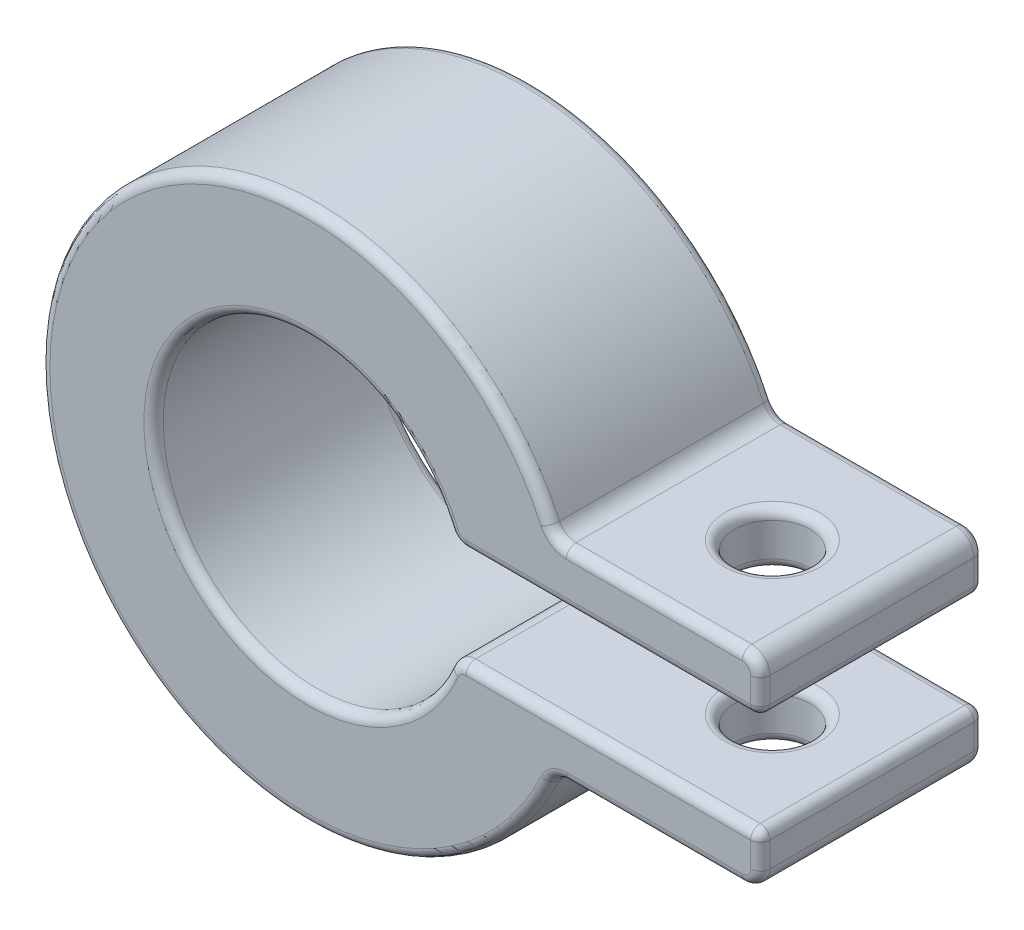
ISO-10303-21;
HEADER;
FILE_DESCRIPTION(('STEP AP214'),'2;1');
FILE_NAME('part.step','',(''),(''),'','','');
FILE_SCHEMA(('AUTOMOTIVE_DESIGN { 1 0 10303 214 1 1 1 1 }'));
ENDSEC;
DATA;
#1=APPLICATION_CONTEXT('core data for automotive mechanical design processes');
#2=APPLICATION_PROTOCOL_DEFINITION('international standard','automotive_design',2000,#1);
#3=PRODUCT_CONTEXT('',#1,'mechanical');
#4=PRODUCT('Part','Part','',(#3));
#5=PRODUCT_RELATED_PRODUCT_CATEGORY('part','',(#4));
#6=PRODUCT_DEFINITION_FORMATION('','',#4);
#7=PRODUCT_DEFINITION_CONTEXT('part definition',#1,'design');
#8=PRODUCT_DEFINITION('design','',#6,#7);
#9=PRODUCT_DEFINITION_SHAPE('','',#8);
#10=(LENGTH_UNIT() NAMED_UNIT(*) SI_UNIT(.MILLI.,.METRE.));
#11=(NAMED_UNIT(*) PLANE_ANGLE_UNIT() SI_UNIT($,.RADIAN.));
#12=(NAMED_UNIT(*) SI_UNIT($,.STERADIAN.) SOLID_ANGLE_UNIT());
#13=UNCERTAINTY_MEASURE_WITH_UNIT(LENGTH_MEASURE(1.E-05),#10,'distance_accuracy_value','');
#14=(GEOMETRIC_REPRESENTATION_CONTEXT(3) GLOBAL_UNCERTAINTY_ASSIGNED_CONTEXT((#13)) GLOBAL_UNIT_ASSIGNED_CONTEXT((#10,
#11,#12)) REPRESENTATION_CONTEXT('',''));
#15=CARTESIAN_POINT('',(0.,0.,0.));
#16=DIRECTION('',(0.,0.,1.));
#17=DIRECTION('',(1.,0.,0.));
#18=AXIS2_PLACEMENT_3D('',#15,#16,#17);
#19=CARTESIAN_POINT('',(36.5759999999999,-7.04850000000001,190.5));
#20=DIRECTION('',(0.,0.,-1.));
#21=DIRECTION('',(-1.,0.,0.));
#22=AXIS2_PLACEMENT_3D('',#19,#20,#21);
#23=CYLINDRICAL_SURFACE('',#22,1.524);
#24=DIRECTION('',(0.,0.,-1.));
#25=VECTOR('',#24,1.);
#26=CARTESIAN_POINT('',(36.575999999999,-8.57249999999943,190.5));
#27=LINE('',#26,#25);
#28=CARTESIAN_POINT('',(36.575999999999,-8.57249999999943,189.6872));
#29=VERTEX_POINT('',#28);
#30=CARTESIAN_POINT('',(36.575999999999,-8.57249999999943,172.5168));
#31=VERTEX_POINT('',#30);
#32=EDGE_CURVE('E338',#29,#31,#27,.T.);
#33=ORIENTED_EDGE('',*,*,#32,.T.);
#34=CARTESIAN_POINT('',(36.5759999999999,-7.04850000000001,172.5168));
#35=DIRECTION('',(0.,0.,-1.));
#36=DIRECTION('',(-1.,0.,0.));
#37=AXIS2_PLACEMENT_3D('',#34,#35,#36);
#38=CIRCLE('',#37,1.524);
#39=CARTESIAN_POINT('',(38.0999999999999,-7.04850000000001,172.5168));
#40=VERTEX_POINT('',#39);
#41=EDGE_CURVE('E429',#31,#40,#38,.F.);
#42=ORIENTED_EDGE('',*,*,#41,.T.);
#43=DIRECTION('',(0.,0.,-1.));
#44=VECTOR('',#43,1.);
#45=CARTESIAN_POINT('',(38.0999999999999,-7.04850000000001,190.5));
#46=LINE('',#45,#44);
#47=CARTESIAN_POINT('',(38.0999999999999,-7.04850000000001,189.6872));
#48=VERTEX_POINT('',#47);
#49=EDGE_CURVE('E244',#48,#40,#46,.T.);
#50=ORIENTED_EDGE('',*,*,#49,.F.);
#51=CARTESIAN_POINT('',(36.5759999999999,-7.04850000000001,189.6872));
#52=DIRECTION('',(0.,0.,-1.));
#53=DIRECTION('',(-1.,0.,0.));
#54=AXIS2_PLACEMENT_3D('',#51,#52,#53);
#55=CIRCLE('',#54,1.524);
#56=EDGE_CURVE('E427',#48,#29,#55,.T.);
#57=ORIENTED_EDGE('',*,*,#56,.T.);
#58=EDGE_LOOP('',(#33,#42,#50,#57));
#59=FACE_BOUND('',#58,.T.);
#60=ADVANCED_FACE('F36',(#59),#23,.T.);
#61=CARTESIAN_POINT('',(38.1,-4.12749999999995,190.5));
#62=DIRECTION('',(-1.,0.,0.));
#63=DIRECTION('',(0.,0.,1.));
#64=AXIS2_PLACEMENT_3D('',#61,#62,#63);
#65=PLANE('',#64);
#66=ORIENTED_EDGE('',*,*,#49,.T.);
#67=DIRECTION('',(0.,1.,0.));
#68=VECTOR('',#67,1.);
#69=CARTESIAN_POINT('',(38.1,-4.12749999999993,172.5168));
#70=LINE('',#69,#68);
#71=CARTESIAN_POINT('',(38.0999999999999,-4.94030000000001,172.5168));
#72=VERTEX_POINT('',#71);
#73=EDGE_CURVE('E425',#40,#72,#70,.T.);
#74=ORIENTED_EDGE('',*,*,#73,.T.);
#75=DIRECTION('',(0.,0.,-1.));
#76=VECTOR('',#75,1.);
#77=CARTESIAN_POINT('',(38.0999999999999,-4.94030000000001,190.5));
#78=LINE('',#77,#76);
#79=CARTESIAN_POINT('',(38.0999999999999,-4.94030000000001,189.6872));
#80=VERTEX_POINT('',#79);
#81=EDGE_CURVE('E421',#72,#80,#78,.F.);
#82=ORIENTED_EDGE('',*,*,#81,.T.);
#83=DIRECTION('',(0.,1.,0.));
#84=VECTOR('',#83,1.);
#85=CARTESIAN_POINT('',(38.1,-4.12749999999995,189.6872));
#86=LINE('',#85,#84);
#87=EDGE_CURVE('E423',#80,#48,#86,.F.);
#88=ORIENTED_EDGE('',*,*,#87,.T.);
#89=EDGE_LOOP('',(#66,#74,#82,#88));
#90=FACE_BOUND('',#89,.T.);
#91=ADVANCED_FACE('F637',(#90),#65,.F.);
#92=CARTESIAN_POINT('',(13.3294047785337,-4.12750000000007,190.5));
#93=DIRECTION('',(0.,-1.,0.));
#94=DIRECTION('',(0.,0.,-1.));
#95=AXIS2_PLACEMENT_3D('',#92,#93,#94);
#96=PLANE('',#95);
#97=CARTESIAN_POINT('',(29.845,-4.12749999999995,181.229));
#98=DIRECTION('',(0.,-1.,0.));
#99=DIRECTION('',(0.,0.,-1.));
#100=AXIS2_PLACEMENT_3D('',#97,#98,#99);
#101=CIRCLE('',#100,3.9878);
#102=CARTESIAN_POINT('',(29.845,-4.12749999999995,177.2412));
#103=VERTEX_POINT('',#102);
#104=EDGE_CURVE('E482',#103,#103,#101,.T.);
#105=ORIENTED_EDGE('',*,*,#104,.T.);
#106=EDGE_LOOP('',(#105));
#107=FACE_BOUND('',#106,.T.);
#108=DIRECTION('',(0.,0.,-1.));
#109=VECTOR('',#108,1.);
#110=CARTESIAN_POINT('',(13.3294047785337,-4.12750000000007,190.5));
#111=LINE('',#110,#109);
#112=CARTESIAN_POINT('',(13.3294047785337,-4.12750000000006,189.6872));
#113=VERTEX_POINT('',#112);
#114=CARTESIAN_POINT('',(13.3294047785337,-4.12750000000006,172.5168));
#115=VERTEX_POINT('',#114);
#116=EDGE_CURVE('E362',#113,#115,#111,.T.);
#117=ORIENTED_EDGE('',*,*,#116,.F.);
#118=DIRECTION('',(-1.,0.,0.));
#119=VECTOR('',#118,1.);
#120=CARTESIAN_POINT('',(13.3294047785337,-4.12750000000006,189.6872));
#121=LINE('',#120,#119);
#122=CARTESIAN_POINT('',(37.2872,-4.12750000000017,189.6872));
#123=VERTEX_POINT('',#122);
#124=EDGE_CURVE('E50',#113,#123,#121,.F.);
#125=ORIENTED_EDGE('',*,*,#124,.T.);
#126=DIRECTION('',(0.,0.,-1.));
#127=VECTOR('',#126,1.);
#128=CARTESIAN_POINT('',(37.2872,-4.12750000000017,190.5));
#129=LINE('',#128,#127);
#130=CARTESIAN_POINT('',(37.2872,-4.12750000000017,172.5168));
#131=VERTEX_POINT('',#130);
#132=EDGE_CURVE('E55',#123,#131,#129,.T.);
#133=ORIENTED_EDGE('',*,*,#132,.T.);
#134=DIRECTION('',(-1.,0.,0.));
#135=VECTOR('',#134,1.);
#136=CARTESIAN_POINT('',(13.3294047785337,-4.12750000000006,172.5168));
#137=LINE('',#136,#135);
#138=EDGE_CURVE('E478',#131,#115,#137,.T.);
#139=ORIENTED_EDGE('',*,*,#138,.T.);
#140=EDGE_LOOP('',(#117,#125,#133,#139));
#141=FACE_BOUND('',#140,.T.);
#142=ADVANCED_FACE('F660',(#107,#141),#96,.F.);
#143=CARTESIAN_POINT('',(13.3294047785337,-5.65150000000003,190.5));
#144=DIRECTION('',(0.,0.,-1.));
#145=DIRECTION('',(-1.,0.,0.));
#146=AXIS2_PLACEMENT_3D('',#143,#144,#145);
#147=CYLINDRICAL_SURFACE('',#146,1.524);
#148=ORIENTED_EDGE('',*,*,#116,.T.);
#149=CARTESIAN_POINT('',(13.3294047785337,-5.65150000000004,172.5168));
#150=DIRECTION('',(0.,0.,-1.));
#151=DIRECTION('',(-1.,0.,0.));
#152=AXIS2_PLACEMENT_3D('',#149,#150,#151);
#153=CIRCLE('',#152,1.524);
#154=CARTESIAN_POINT('',(11.9263095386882,-5.05660526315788,172.5168));
#155=VERTEX_POINT('',#154);
#156=EDGE_CURVE('E408',#115,#155,#153,.F.);
#157=ORIENTED_EDGE('',*,*,#156,.T.);
#158=DIRECTION('',(0.,0.,-1.));
#159=VECTOR('',#158,1.);
#160=CARTESIAN_POINT('',(11.9263095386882,-5.05660526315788,190.5));
#161=LINE('',#160,#159);
#162=CARTESIAN_POINT('',(11.9263095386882,-5.05660526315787,189.6872));
#163=VERTEX_POINT('',#162);
#164=EDGE_CURVE('E359',#163,#155,#161,.T.);
#165=ORIENTED_EDGE('',*,*,#164,.F.);
#166=CARTESIAN_POINT('',(13.3294047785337,-5.65150000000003,189.6872));
#167=DIRECTION('',(0.,0.,-1.));
#168=DIRECTION('',(-1.,0.,0.));
#169=AXIS2_PLACEMENT_3D('',#166,#167,#168);
#170=CIRCLE('',#169,1.524);
#171=EDGE_CURVE('E406',#163,#113,#170,.T.);
#172=ORIENTED_EDGE('',*,*,#171,.T.);
#173=EDGE_LOOP('',(#148,#157,#165,#172));
#174=FACE_BOUND('',#173,.T.);
#175=ADVANCED_FACE('F662',(#174),#147,.T.);
#176=CARTESIAN_POINT('',(0.,0.,190.5));
#177=DIRECTION('',(0.,0.,-1.));
#178=DIRECTION('',(-1.,0.,0.));
#179=AXIS2_PLACEMENT_3D('',#176,#177,#178);
#180=CYLINDRICAL_SURFACE('',#179,12.954);
#181=ORIENTED_EDGE('',*,*,#164,.T.);
#182=CARTESIAN_POINT('',(0.,0.,172.5168));
#183=DIRECTION('',(0.,0.,-1.));
#184=DIRECTION('',(-1.,0.,0.));
#185=AXIS2_PLACEMENT_3D('',#182,#183,#184);
#186=CIRCLE('',#185,12.954);
#187=CARTESIAN_POINT('',(11.9263095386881,5.05660526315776,172.5168));
#188=VERTEX_POINT('',#187);
#189=EDGE_CURVE('E404',#155,#188,#186,.T.);
#190=ORIENTED_EDGE('',*,*,#189,.T.);
#191=DIRECTION('',(0.,0.,-1.));
#192=VECTOR('',#191,1.);
#193=CARTESIAN_POINT('',(11.9263095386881,5.05660526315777,190.5));
#194=LINE('',#193,#192);
#195=CARTESIAN_POINT('',(11.9263095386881,5.05660526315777,189.6872));
#196=VERTEX_POINT('',#195);
#197=EDGE_CURVE('E254',#196,#188,#194,.T.);
#198=ORIENTED_EDGE('',*,*,#197,.F.);
#199=CARTESIAN_POINT('',(0.,0.,189.6872));
#200=DIRECTION('',(0.,0.,-1.));
#201=DIRECTION('',(-1.,0.,0.));
#202=AXIS2_PLACEMENT_3D('',#199,#200,#201);
#203=CIRCLE('',#202,12.954);
#204=EDGE_CURVE('E402',#196,#163,#203,.F.);
#205=ORIENTED_EDGE('',*,*,#204,.T.);
#206=EDGE_LOOP('',(#181,#190,#198,#205));
#207=FACE_BOUND('',#206,.T.);
#208=ADVANCED_FACE('F701',(#207),#180,.F.);
#209=CARTESIAN_POINT('',(13.3294047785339,5.65150000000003,190.5));
#210=DIRECTION('',(0.,0.,-1.));
#211=DIRECTION('',(-1.,0.,0.));
#212=AXIS2_PLACEMENT_3D('',#209,#210,#211);
#213=CYLINDRICAL_SURFACE('',#212,1.524);
#214=ORIENTED_EDGE('',*,*,#197,.T.);
#215=CARTESIAN_POINT('',(13.3294047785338,5.65150000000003,172.5168));
#216=DIRECTION('',(0.,0.,-1.));
#217=DIRECTION('',(-1.,0.,0.));
#218=AXIS2_PLACEMENT_3D('',#215,#216,#217);
#219=CIRCLE('',#218,1.524);
#220=CARTESIAN_POINT('',(13.3294047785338,4.12749999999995,172.5168));
#221=VERTEX_POINT('',#220);
#222=EDGE_CURVE('E253',#188,#221,#219,.F.);
#223=ORIENTED_EDGE('',*,*,#222,.T.);
#224=DIRECTION('',(0.,0.,-1.));
#225=VECTOR('',#224,1.);
#226=CARTESIAN_POINT('',(13.3294047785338,4.12749999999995,190.5));
#227=LINE('',#226,#225);
#228=CARTESIAN_POINT('',(13.3294047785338,4.12749999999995,189.6872));
#229=VERTEX_POINT('',#228);
#230=EDGE_CURVE('E236',#229,#221,#227,.T.);
#231=ORIENTED_EDGE('',*,*,#230,.F.);
#232=CARTESIAN_POINT('',(13.3294047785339,5.65150000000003,189.6872));
#233=DIRECTION('',(0.,0.,-1.));
#234=DIRECTION('',(-1.,0.,0.));
#235=AXIS2_PLACEMENT_3D('',#232,#233,#234);
#236=CIRCLE('',#235,1.524);
#237=EDGE_CURVE('E250',#229,#196,#236,.T.);
#238=ORIENTED_EDGE('',*,*,#237,.T.);
#239=EDGE_LOOP('',(#214,#223,#231,#238));
#240=FACE_BOUND('',#239,.T.);
#241=ADVANCED_FACE('F249',(#240),#213,.T.);
#242=CARTESIAN_POINT('',(13.3294047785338,4.12749999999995,190.5));
#243=DIRECTION('',(0.,1.,0.));
#244=DIRECTION('',(0.,0.,1.));
#245=AXIS2_PLACEMENT_3D('',#242,#243,#244);
#246=PLANE('',#245);
#247=CARTESIAN_POINT('',(29.845,4.12750000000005,181.229));
#248=DIRECTION('',(0.,1.,0.));
#249=DIRECTION('',(0.,0.,1.));
#250=AXIS2_PLACEMENT_3D('',#247,#248,#249);
#251=CIRCLE('',#250,3.9878);
#252=CARTESIAN_POINT('',(29.845,4.12750000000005,185.2168));
#253=VERTEX_POINT('',#252);
#254=EDGE_CURVE('E370',#253,#253,#251,.T.);
#255=ORIENTED_EDGE('',*,*,#254,.T.);
#256=EDGE_LOOP('',(#255));
#257=FACE_BOUND('',#256,.T.);
#258=ORIENTED_EDGE('',*,*,#230,.T.);
#259=DIRECTION('',(1.,0.,0.));
#260=VECTOR('',#259,1.);
#261=CARTESIAN_POINT('',(38.1,4.12750000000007,172.5168));
#262=LINE('',#261,#260);
#263=CARTESIAN_POINT('',(37.2872,4.12749999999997,172.5168));
#264=VERTEX_POINT('',#263);
#265=EDGE_CURVE('E368',#221,#264,#262,.T.);
#266=ORIENTED_EDGE('',*,*,#265,.T.);
#267=DIRECTION('',(0.,0.,-1.));
#268=VECTOR('',#267,1.);
#269=CARTESIAN_POINT('',(37.2872,4.12749999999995,190.5));
#270=LINE('',#269,#268);
#271=CARTESIAN_POINT('',(37.2872,4.12749999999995,189.6872));
#272=VERTEX_POINT('',#271);
#273=EDGE_CURVE('E239',#264,#272,#270,.F.);
#274=ORIENTED_EDGE('',*,*,#273,.T.);
#275=DIRECTION('',(1.,0.,0.));
#276=VECTOR('',#275,1.);
#277=CARTESIAN_POINT('',(13.3294047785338,4.12749999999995,189.6872));
#278=LINE('',#277,#276);
#279=EDGE_CURVE('E232',#272,#229,#278,.F.);
#280=ORIENTED_EDGE('',*,*,#279,.T.);
#281=EDGE_LOOP('',(#258,#266,#274,#280));
#282=FACE_BOUND('',#281,.T.);
#283=ADVANCED_FACE('F234',(#257,#282),#246,.F.);
#284=CARTESIAN_POINT('',(38.1,4.12750000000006,190.5));
#285=DIRECTION('',(-1.,0.,0.));
#286=DIRECTION('',(0.,0.,1.));
#287=AXIS2_PLACEMENT_3D('',#284,#285,#286);
#288=PLANE('',#287);
#289=DIRECTION('',(0.,0.,-1.));
#290=VECTOR('',#289,1.);
#291=CARTESIAN_POINT('',(38.0999999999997,4.94030000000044,190.5));
#292=LINE('',#291,#290);
#293=CARTESIAN_POINT('',(38.0999999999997,4.94030000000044,189.6872));
#294=VERTEX_POINT('',#293);
#295=CARTESIAN_POINT('',(38.0999999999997,4.94030000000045,172.5168));
#296=VERTEX_POINT('',#295);
#297=EDGE_CURVE('E410',#294,#296,#292,.T.);
#298=ORIENTED_EDGE('',*,*,#297,.T.);
#299=DIRECTION('',(0.,1.,0.));
#300=VECTOR('',#299,1.);
#301=CARTESIAN_POINT('',(38.1,7.04850000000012,172.5168));
#302=LINE('',#301,#300);
#303=CARTESIAN_POINT('',(38.1,7.04850000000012,172.5168));
#304=VERTEX_POINT('',#303);
#305=EDGE_CURVE('E414',#296,#304,#302,.T.);
#306=ORIENTED_EDGE('',*,*,#305,.T.);
#307=DIRECTION('',(0.,0.,-1.));
#308=VECTOR('',#307,1.);
#309=CARTESIAN_POINT('',(38.1,7.04850000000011,190.5));
#310=LINE('',#309,#308);
#311=CARTESIAN_POINT('',(38.1,7.04850000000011,189.6872));
#312=VERTEX_POINT('',#311);
#313=EDGE_CURVE('E255',#312,#304,#310,.T.);
#314=ORIENTED_EDGE('',*,*,#313,.F.);
#315=DIRECTION('',(0.,1.,0.));
#316=VECTOR('',#315,1.);
#317=CARTESIAN_POINT('',(38.1,4.12750000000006,189.6872));
#318=LINE('',#317,#316);
#319=EDGE_CURVE('E412',#312,#294,#318,.F.);
#320=ORIENTED_EDGE('',*,*,#319,.T.);
#321=EDGE_LOOP('',(#298,#306,#314,#320));
#322=FACE_BOUND('',#321,.T.);
#323=ADVANCED_FACE('F539',(#322),#288,.F.);
#324=CARTESIAN_POINT('',(36.576,7.04850000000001,190.5));
#325=DIRECTION('',(0.,0.,-1.));
#326=DIRECTION('',(-1.,0.,0.));
#327=AXIS2_PLACEMENT_3D('',#324,#325,#326);
#328=CYLINDRICAL_SURFACE('',#327,1.524);
#329=ORIENTED_EDGE('',*,*,#313,.T.);
#330=CARTESIAN_POINT('',(36.576,7.04850000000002,172.5168));
#331=DIRECTION('',(0.,0.,-1.));
#332=DIRECTION('',(-1.,0.,0.));
#333=AXIS2_PLACEMENT_3D('',#330,#331,#332);
#334=CIRCLE('',#333,1.524);
#335=CARTESIAN_POINT('',(36.5759999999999,8.5725000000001,172.5168));
#336=VERTEX_POINT('',#335);
#337=EDGE_CURVE('E419',#304,#336,#334,.F.);
#338=ORIENTED_EDGE('',*,*,#337,.T.);
#339=DIRECTION('',(0.,0.,-1.));
#340=VECTOR('',#339,1.);
#341=CARTESIAN_POINT('',(36.5759999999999,8.57250000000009,190.5));
#342=LINE('',#341,#340);
#343=CARTESIAN_POINT('',(36.5759999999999,8.57250000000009,189.6872));
#344=VERTEX_POINT('',#343);
#345=EDGE_CURVE('E353',#344,#336,#342,.T.);
#346=ORIENTED_EDGE('',*,*,#345,.F.);
#347=CARTESIAN_POINT('',(36.576,7.04850000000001,189.6872));
#348=DIRECTION('',(0.,0.,-1.));
#349=DIRECTION('',(-1.,0.,0.));
#350=AXIS2_PLACEMENT_3D('',#347,#348,#349);
#351=CIRCLE('',#350,1.524);
#352=EDGE_CURVE('E417',#344,#312,#351,.T.);
#353=ORIENTED_EDGE('',*,*,#352,.T.);
#354=EDGE_LOOP('',(#329,#338,#346,#353));
#355=FACE_BOUND('',#354,.T.);
#356=ADVANCED_FACE('F513',(#355),#328,.T.);
#357=CARTESIAN_POINT('',(36.5759999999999,8.57250000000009,190.5));
#358=DIRECTION('',(0.,-1.,0.));
#359=DIRECTION('',(1.,0.,0.));
#360=AXIS2_PLACEMENT_3D('',#357,#358,#359);
#361=PLANE('',#360);
#362=CARTESIAN_POINT('',(29.8449999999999,8.57249999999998,181.229));
#363=DIRECTION('',(0.,-1.,0.));
#364=DIRECTION('',(1.,0.,0.));
#365=AXIS2_PLACEMENT_3D('',#362,#363,#364);
#366=CIRCLE('',#365,3.9878);
#367=CARTESIAN_POINT('',(33.8327999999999,8.57249999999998,181.229));
#368=VERTEX_POINT('',#367);
#369=EDGE_CURVE('E487',#368,#368,#366,.T.);
#370=ORIENTED_EDGE('',*,*,#369,.T.);
#371=EDGE_LOOP('',(#370));
#372=FACE_BOUND('',#371,.T.);
#373=DIRECTION('',(0.,0.,-1.));
#374=VECTOR('',#373,1.);
#375=CARTESIAN_POINT('',(21.7762415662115,8.57249999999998,190.5));
#376=LINE('',#375,#374);
#377=CARTESIAN_POINT('',(21.7762415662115,8.57249999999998,189.6872));
#378=VERTEX_POINT('',#377);
#379=CARTESIAN_POINT('',(21.7762415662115,8.5725,172.5168));
#380=VERTEX_POINT('',#379);
#381=EDGE_CURVE('E350',#378,#380,#376,.T.);
#382=ORIENTED_EDGE('',*,*,#381,.F.);
#383=DIRECTION('',(-1.,0.,0.));
#384=VECTOR('',#383,1.);
#385=CARTESIAN_POINT('',(36.5759999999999,8.57250000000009,189.6872));
#386=LINE('',#385,#384);
#387=EDGE_CURVE('E490',#378,#344,#386,.F.);
#388=ORIENTED_EDGE('',*,*,#387,.T.);
#389=ORIENTED_EDGE('',*,*,#345,.T.);
#390=DIRECTION('',(-1.,0.,0.));
#391=VECTOR('',#390,1.);
#392=CARTESIAN_POINT('',(21.7762415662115,8.5725,172.5168));
#393=LINE('',#392,#391);
#394=EDGE_CURVE('E485',#336,#380,#393,.T.);
#395=ORIENTED_EDGE('',*,*,#394,.T.);
#396=EDGE_LOOP('',(#382,#388,#389,#395));
#397=FACE_BOUND('',#396,.T.);
#398=ADVANCED_FACE('F509',(#372,#397),#361,.F.);
#399=CARTESIAN_POINT('',(21.7762415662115,10.0965000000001,190.5));
#400=DIRECTION('',(0.,0.,-1.));
#401=DIRECTION('',(-1.,0.,0.));
#402=AXIS2_PLACEMENT_3D('',#399,#400,#401);
#403=CYLINDRICAL_SURFACE('',#402,1.524);
#404=ORIENTED_EDGE('',*,*,#381,.T.);
#405=CARTESIAN_POINT('',(21.7762415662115,10.0965000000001,172.5168));
#406=DIRECTION('',(0.,0.,-1.));
#407=DIRECTION('',(-1.,0.,0.));
#408=AXIS2_PLACEMENT_3D('',#405,#406,#407);
#409=CIRCLE('',#408,1.524);
#410=CARTESIAN_POINT('',(20.393623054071,9.45545238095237,172.5168));
#411=VERTEX_POINT('',#410);
#412=EDGE_CURVE('E448',#380,#411,#409,.T.);
#413=ORIENTED_EDGE('',*,*,#412,.T.);
#414=DIRECTION('',(0.,0.,-1.));
#415=VECTOR('',#414,1.);
#416=CARTESIAN_POINT('',(20.393623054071,9.45545238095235,190.5));
#417=LINE('',#416,#415);
#418=CARTESIAN_POINT('',(20.393623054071,9.45545238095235,189.6872));
#419=VERTEX_POINT('',#418);
#420=EDGE_CURVE('E347',#419,#411,#417,.T.);
#421=ORIENTED_EDGE('',*,*,#420,.F.);
#422=CARTESIAN_POINT('',(21.7762415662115,10.0965000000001,189.6872));
#423=DIRECTION('',(0.,0.,-1.));
#424=DIRECTION('',(-1.,0.,0.));
#425=AXIS2_PLACEMENT_3D('',#422,#423,#424);
#426=CIRCLE('',#425,1.524);
#427=EDGE_CURVE('E446',#419,#378,#426,.F.);
#428=ORIENTED_EDGE('',*,*,#427,.T.);
#429=EDGE_LOOP('',(#404,#413,#421,#428));
#430=FACE_BOUND('',#429,.T.);
#431=ADVANCED_FACE('F512',(#430),#403,.F.);
#432=CARTESIAN_POINT('',(0.,0.,190.5));
#433=DIRECTION('',(0.,0.,-1.));
#434=DIRECTION('',(-1.,0.,0.));
#435=AXIS2_PLACEMENT_3D('',#432,#433,#434);
#436=CYLINDRICAL_SURFACE('',#435,22.479);
#437=ORIENTED_EDGE('',*,*,#420,.T.);
#438=CARTESIAN_POINT('',(0.,0.,172.5168));
#439=DIRECTION('',(0.,0.,-1.));
#440=DIRECTION('',(-1.,0.,0.));
#441=AXIS2_PLACEMENT_3D('',#438,#439,#440);
#442=CIRCLE('',#441,22.479);
#443=CARTESIAN_POINT('',(20.3936230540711,-9.45545238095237,172.5168));
#444=VERTEX_POINT('',#443);
#445=EDGE_CURVE('E444',#411,#444,#442,.F.);
#446=ORIENTED_EDGE('',*,*,#445,.T.);
#447=DIRECTION('',(0.,0.,-1.));
#448=VECTOR('',#447,1.);
#449=CARTESIAN_POINT('',(20.3936230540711,-9.45545238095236,190.5));
#450=LINE('',#449,#448);
#451=CARTESIAN_POINT('',(20.3936230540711,-9.45545238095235,189.6872));
#452=VERTEX_POINT('',#451);
#453=EDGE_CURVE('E344',#452,#444,#450,.T.);
#454=ORIENTED_EDGE('',*,*,#453,.F.);
#455=CARTESIAN_POINT('',(0.,0.,189.6872));
#456=DIRECTION('',(0.,0.,-1.));
#457=DIRECTION('',(-1.,0.,0.));
#458=AXIS2_PLACEMENT_3D('',#455,#456,#457);
#459=CIRCLE('',#458,22.479);
#460=EDGE_CURVE('E442',#452,#419,#459,.T.);
#461=ORIENTED_EDGE('',*,*,#460,.T.);
#462=EDGE_LOOP('',(#437,#446,#454,#461));
#463=FACE_BOUND('',#462,.T.);
#464=ADVANCED_FACE('F602',(#463),#436,.T.);
#465=CARTESIAN_POINT('',(21.7762415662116,-10.0965,190.5));
#466=DIRECTION('',(0.,0.,-1.));
#467=DIRECTION('',(-1.,0.,0.));
#468=AXIS2_PLACEMENT_3D('',#465,#466,#467);
#469=CYLINDRICAL_SURFACE('',#468,1.524);
#470=ORIENTED_EDGE('',*,*,#453,.T.);
#471=CARTESIAN_POINT('',(21.7762415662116,-10.0965,172.5168));
#472=DIRECTION('',(0.,0.,-1.));
#473=DIRECTION('',(-1.,0.,0.));
#474=AXIS2_PLACEMENT_3D('',#471,#472,#473);
#475=CIRCLE('',#474,1.524);
#476=CARTESIAN_POINT('',(21.7762415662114,-8.5725000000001,172.5168));
#477=VERTEX_POINT('',#476);
#478=EDGE_CURVE('E440',#444,#477,#475,.T.);
#479=ORIENTED_EDGE('',*,*,#478,.T.);
#480=DIRECTION('',(0.,0.,-1.));
#481=VECTOR('',#480,1.);
#482=CARTESIAN_POINT('',(21.7762415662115,-8.5725000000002,190.5));
#483=LINE('',#482,#481);
#484=CARTESIAN_POINT('',(21.7762415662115,-8.5725000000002,189.6872));
#485=VERTEX_POINT('',#484);
#486=EDGE_CURVE('E341',#485,#477,#483,.T.);
#487=ORIENTED_EDGE('',*,*,#486,.F.);
#488=CARTESIAN_POINT('',(21.7762415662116,-10.0965,189.6872));
#489=DIRECTION('',(0.,0.,-1.));
#490=DIRECTION('',(-1.,0.,0.));
#491=AXIS2_PLACEMENT_3D('',#488,#489,#490);
#492=CIRCLE('',#491,1.524);
#493=EDGE_CURVE('E438',#485,#452,#492,.F.);
#494=ORIENTED_EDGE('',*,*,#493,.T.);
#495=EDGE_LOOP('',(#470,#479,#487,#494));
#496=FACE_BOUND('',#495,.T.);
#497=ADVANCED_FACE('F616',(#496),#469,.F.);
#498=CARTESIAN_POINT('',(36.575999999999,-8.57249999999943,190.5));
#499=DIRECTION('',(0.,1.,0.));
#500=DIRECTION('',(-1.,0.,0.));
#501=AXIS2_PLACEMENT_3D('',#498,#499,#500);
#502=PLANE('',#501);
#503=CARTESIAN_POINT('',(29.8449999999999,-8.5725,181.229));
#504=DIRECTION('',(0.,1.,0.));
#505=DIRECTION('',(-1.,0.,0.));
#506=AXIS2_PLACEMENT_3D('',#503,#504,#505);
#507=CIRCLE('',#506,3.9878);
#508=CARTESIAN_POINT('',(25.8571999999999,-8.5725,181.229));
#509=VERTEX_POINT('',#508);
#510=EDGE_CURVE('E431',#509,#509,#507,.T.);
#511=ORIENTED_EDGE('',*,*,#510,.T.);
#512=EDGE_LOOP('',(#511));
#513=FACE_BOUND('',#512,.T.);
#514=ORIENTED_EDGE('',*,*,#486,.T.);
#515=DIRECTION('',(1.,0.,0.));
#516=VECTOR('',#515,1.);
#517=CARTESIAN_POINT('',(36.575999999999,-8.57249999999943,172.5168));
#518=LINE('',#517,#516);
#519=EDGE_CURVE('E436',#477,#31,#518,.T.);
#520=ORIENTED_EDGE('',*,*,#519,.T.);
#521=ORIENTED_EDGE('',*,*,#32,.F.);
#522=DIRECTION('',(1.,0.,0.));
#523=VECTOR('',#522,1.);
#524=CARTESIAN_POINT('',(36.575999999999,-8.57249999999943,189.6872));
#525=LINE('',#524,#523);
#526=EDGE_CURVE('E434',#29,#485,#525,.F.);
#527=ORIENTED_EDGE('',*,*,#526,.T.);
#528=EDGE_LOOP('',(#514,#520,#521,#527));
#529=FACE_BOUND('',#528,.T.);
#530=ADVANCED_FACE('F620',(#513,#529),#502,.F.);
#531=CARTESIAN_POINT('',(36.5759999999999,-7.04850000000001,190.5));
#532=DIRECTION('',(0.,0.,-1.));
#533=DIRECTION('',(-1.,0.,0.));
#534=AXIS2_PLACEMENT_3D('',#531,#532,#533);
#535=PLANE('',#534);
#536=DIRECTION('',(-1.,0.,0.));
#537=VECTOR('',#536,1.);
#538=CARTESIAN_POINT('',(36.576,-4.94029999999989,190.5));
#539=LINE('',#538,#537);
#540=CARTESIAN_POINT('',(37.2872,-4.94030000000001,190.5));
#541=VERTEX_POINT('',#540);
#542=CARTESIAN_POINT('',(13.3294047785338,-4.94030000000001,190.5));
#543=VERTEX_POINT('',#542);
#544=EDGE_CURVE('E468',#541,#543,#539,.T.);
#545=ORIENTED_EDGE('',*,*,#544,.T.);
#546=CARTESIAN_POINT('',(13.3294047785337,-5.65150000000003,190.5));
#547=DIRECTION('',(0.,0.,-1.));
#548=DIRECTION('',(-1.,0.,0.));
#549=AXIS2_PLACEMENT_3D('',#546,#547,#548);
#550=CIRCLE('',#549,0.7112);
#551=CARTESIAN_POINT('',(12.6746269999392,-5.37388245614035,190.5));
#552=VERTEX_POINT('',#551);
#553=EDGE_CURVE('E476',#543,#552,#550,.F.);
#554=ORIENTED_EDGE('',*,*,#553,.T.);
#555=CARTESIAN_POINT('',(0.,0.,190.5));
#556=DIRECTION('',(0.,0.,-1.));
#557=DIRECTION('',(-1.,0.,0.));
#558=AXIS2_PLACEMENT_3D('',#555,#556,#557);
#559=CIRCLE('',#558,13.7668);
#560=CARTESIAN_POINT('',(12.6746269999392,5.37388245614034,190.5));
#561=VERTEX_POINT('',#560);
#562=EDGE_CURVE('E474',#552,#561,#559,.T.);
#563=ORIENTED_EDGE('',*,*,#562,.T.);
#564=CARTESIAN_POINT('',(13.3294047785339,5.65150000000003,190.5));
#565=DIRECTION('',(0.,0.,-1.));
#566=DIRECTION('',(-1.,0.,0.));
#567=AXIS2_PLACEMENT_3D('',#564,#565,#566);
#568=CIRCLE('',#567,0.7112);
#569=CARTESIAN_POINT('',(13.3294047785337,4.94030000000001,190.5));
#570=VERTEX_POINT('',#569);
#571=EDGE_CURVE('E472',#561,#570,#568,.F.);
#572=ORIENTED_EDGE('',*,*,#571,.T.);
#573=DIRECTION('',(1.,0.,0.));
#574=VECTOR('',#573,1.);
#575=CARTESIAN_POINT('',(36.576,4.94030000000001,190.5));
#576=LINE('',#575,#574);
#577=CARTESIAN_POINT('',(37.2871999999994,4.9403000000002,190.5));
#578=VERTEX_POINT('',#577);
#579=EDGE_CURVE('E269',#570,#578,#576,.T.);
#580=ORIENTED_EDGE('',*,*,#579,.T.);
#581=DIRECTION('',(0.,1.,0.));
#582=VECTOR('',#581,1.);
#583=CARTESIAN_POINT('',(37.2872,-7.0485,190.5));
#584=LINE('',#583,#582);
#585=CARTESIAN_POINT('',(37.2871999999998,7.0485,190.5));
#586=VERTEX_POINT('',#585);
#587=EDGE_CURVE('E466',#578,#586,#584,.T.);
#588=ORIENTED_EDGE('',*,*,#587,.T.);
#589=CARTESIAN_POINT('',(36.576,7.04850000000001,190.5));
#590=DIRECTION('',(0.,0.,-1.));
#591=DIRECTION('',(-1.,0.,0.));
#592=AXIS2_PLACEMENT_3D('',#589,#590,#591);
#593=CIRCLE('',#592,0.711199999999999);
#594=CARTESIAN_POINT('',(36.5759999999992,7.75970000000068,190.5));
#595=VERTEX_POINT('',#594);
#596=EDGE_CURVE('E464',#586,#595,#593,.F.);
#597=ORIENTED_EDGE('',*,*,#596,.T.);
#598=DIRECTION('',(-1.,0.,0.));
#599=VECTOR('',#598,1.);
#600=CARTESIAN_POINT('',(36.5759999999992,7.75970000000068,190.5));
#601=LINE('',#600,#599);
#602=CARTESIAN_POINT('',(21.7762415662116,7.75970000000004,190.5));
#603=VERTEX_POINT('',#602);
#604=EDGE_CURVE('E462',#595,#603,#601,.T.);
#605=ORIENTED_EDGE('',*,*,#604,.T.);
#606=CARTESIAN_POINT('',(21.7762415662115,10.0965000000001,190.5));
#607=DIRECTION('',(0.,0.,-1.));
#608=DIRECTION('',(-1.,0.,0.));
#609=AXIS2_PLACEMENT_3D('',#606,#607,#608);
#610=CIRCLE('',#609,2.3368);
#611=CARTESIAN_POINT('',(19.6562265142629,9.11356031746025,190.5));
#612=VERTEX_POINT('',#611);
#613=EDGE_CURVE('E460',#603,#612,#610,.T.);
#614=ORIENTED_EDGE('',*,*,#613,.T.);
#615=CARTESIAN_POINT('',(0.,0.,190.5));
#616=DIRECTION('',(0.,0.,-1.));
#617=DIRECTION('',(-1.,0.,0.));
#618=AXIS2_PLACEMENT_3D('',#615,#616,#617);
#619=CIRCLE('',#618,21.6662);
#620=CARTESIAN_POINT('',(19.6562265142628,-9.11356031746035,190.5));
#621=VERTEX_POINT('',#620);
#622=EDGE_CURVE('E450',#612,#621,#619,.F.);
#623=ORIENTED_EDGE('',*,*,#622,.T.);
#624=CARTESIAN_POINT('',(21.7762415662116,-10.0965,190.5));
#625=DIRECTION('',(0.,0.,-1.));
#626=DIRECTION('',(-1.,0.,0.));
#627=AXIS2_PLACEMENT_3D('',#624,#625,#626);
#628=CIRCLE('',#627,2.3368);
#629=CARTESIAN_POINT('',(21.7762415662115,-7.75970000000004,190.5));
#630=VERTEX_POINT('',#629);
#631=EDGE_CURVE('E452',#621,#630,#628,.T.);
#632=ORIENTED_EDGE('',*,*,#631,.T.);
#633=DIRECTION('',(1.,0.,0.));
#634=VECTOR('',#633,1.);
#635=CARTESIAN_POINT('',(36.576,-7.75969999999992,190.5));
#636=LINE('',#635,#634);
#637=CARTESIAN_POINT('',(36.576,-7.75969999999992,190.5));
#638=VERTEX_POINT('',#637);
#639=EDGE_CURVE('E454',#630,#638,#636,.T.);
#640=ORIENTED_EDGE('',*,*,#639,.T.);
#641=CARTESIAN_POINT('',(36.5759999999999,-7.04850000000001,190.5));
#642=DIRECTION('',(0.,0.,-1.));
#643=DIRECTION('',(-1.,0.,0.));
#644=AXIS2_PLACEMENT_3D('',#641,#642,#643);
#645=CIRCLE('',#644,0.711199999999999);
#646=CARTESIAN_POINT('',(37.2872,-7.0485,190.5));
#647=VERTEX_POINT('',#646);
#648=EDGE_CURVE('E456',#638,#647,#645,.F.);
#649=ORIENTED_EDGE('',*,*,#648,.T.);
#650=DIRECTION('',(0.,1.,0.));
#651=VECTOR('',#650,1.);
#652=CARTESIAN_POINT('',(37.2872,-7.0485,190.5));
#653=LINE('',#652,#651);
#654=EDGE_CURVE('E458',#647,#541,#653,.T.);
#655=ORIENTED_EDGE('',*,*,#654,.T.);
#656=EDGE_LOOP('',(#545,#554,#563,#572,#580,#588,#597,#605,#614,#623,#632,#640,#649,#655));
#657=FACE_BOUND('',#656,.T.);
#658=ADVANCED_FACE('F674',(#657),#535,.F.);
#659=CARTESIAN_POINT('',(36.5759999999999,-7.04850000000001,171.704));
#660=DIRECTION('',(0.,0.,-1.));
#661=DIRECTION('',(-1.,0.,0.));
#662=AXIS2_PLACEMENT_3D('',#659,#660,#661);
#663=PLANE('',#662);
#664=DIRECTION('',(1.,0.,0.));
#665=VECTOR('',#664,1.);
#666=CARTESIAN_POINT('',(13.3294047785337,4.94030000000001,171.704));
#667=LINE('',#666,#665);
#668=CARTESIAN_POINT('',(37.2871999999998,4.94030000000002,171.704));
#669=VERTEX_POINT('',#668);
#670=CARTESIAN_POINT('',(13.3294047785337,4.94030000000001,171.704));
#671=VERTEX_POINT('',#670);
#672=EDGE_CURVE('E391',#669,#671,#667,.F.);
#673=ORIENTED_EDGE('',*,*,#672,.T.);
#674=CARTESIAN_POINT('',(13.3294047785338,5.65150000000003,171.704));
#675=DIRECTION('',(0.,0.,-1.));
#676=DIRECTION('',(-1.,0.,0.));
#677=AXIS2_PLACEMENT_3D('',#674,#675,#676);
#678=CIRCLE('',#677,0.7112);
#679=CARTESIAN_POINT('',(12.6746269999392,5.37388245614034,171.704));
#680=VERTEX_POINT('',#679);
#681=EDGE_CURVE('E266',#671,#680,#678,.T.);
#682=ORIENTED_EDGE('',*,*,#681,.T.);
#683=CARTESIAN_POINT('',(0.,0.,171.704));
#684=DIRECTION('',(0.,0.,-1.));
#685=DIRECTION('',(-1.,0.,0.));
#686=AXIS2_PLACEMENT_3D('',#683,#684,#685);
#687=CIRCLE('',#686,13.7668);
#688=CARTESIAN_POINT('',(12.6746269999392,-5.37388245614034,171.704));
#689=VERTEX_POINT('',#688);
#690=EDGE_CURVE('E398',#680,#689,#687,.F.);
#691=ORIENTED_EDGE('',*,*,#690,.T.);
#692=CARTESIAN_POINT('',(13.3294047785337,-5.65150000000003,171.704));
#693=DIRECTION('',(0.,0.,-1.));
#694=DIRECTION('',(-1.,0.,0.));
#695=AXIS2_PLACEMENT_3D('',#692,#693,#694);
#696=CIRCLE('',#695,0.7112);
#697=CARTESIAN_POINT('',(13.3294047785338,-4.94030000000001,171.704));
#698=VERTEX_POINT('',#697);
#699=EDGE_CURVE('E396',#689,#698,#696,.T.);
#700=ORIENTED_EDGE('',*,*,#699,.T.);
#701=DIRECTION('',(-1.,0.,0.));
#702=VECTOR('',#701,1.);
#703=CARTESIAN_POINT('',(38.0999999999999,-4.94030000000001,171.704));
#704=LINE('',#703,#702);
#705=CARTESIAN_POINT('',(37.2872,-4.94030000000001,171.704));
#706=VERTEX_POINT('',#705);
#707=EDGE_CURVE('E394',#698,#706,#704,.F.);
#708=ORIENTED_EDGE('',*,*,#707,.T.);
#709=DIRECTION('',(0.,1.,0.));
#710=VECTOR('',#709,1.);
#711=CARTESIAN_POINT('',(37.2872,-7.0485,171.704));
#712=LINE('',#711,#710);
#713=CARTESIAN_POINT('',(37.2872,-7.0485,171.704));
#714=VERTEX_POINT('',#713);
#715=EDGE_CURVE('E385',#706,#714,#712,.F.);
#716=ORIENTED_EDGE('',*,*,#715,.T.);
#717=CARTESIAN_POINT('',(36.5759999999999,-7.04850000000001,171.704));
#718=DIRECTION('',(0.,0.,-1.));
#719=DIRECTION('',(-1.,0.,0.));
#720=AXIS2_PLACEMENT_3D('',#717,#718,#719);
#721=CIRCLE('',#720,0.711199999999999);
#722=CARTESIAN_POINT('',(36.576,-7.75969999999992,171.704));
#723=VERTEX_POINT('',#722);
#724=EDGE_CURVE('E383',#714,#723,#721,.T.);
#725=ORIENTED_EDGE('',*,*,#724,.T.);
#726=DIRECTION('',(1.,0.,0.));
#727=VECTOR('',#726,1.);
#728=CARTESIAN_POINT('',(21.7762415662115,-7.75970000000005,171.704));
#729=LINE('',#728,#727);
#730=CARTESIAN_POINT('',(21.7762415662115,-7.75970000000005,171.704));
#731=VERTEX_POINT('',#730);
#732=EDGE_CURVE('E381',#723,#731,#729,.F.);
#733=ORIENTED_EDGE('',*,*,#732,.T.);
#734=CARTESIAN_POINT('',(21.7762415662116,-10.0965,171.704));
#735=DIRECTION('',(0.,0.,-1.));
#736=DIRECTION('',(-1.,0.,0.));
#737=AXIS2_PLACEMENT_3D('',#734,#735,#736);
#738=CIRCLE('',#737,2.3368);
#739=CARTESIAN_POINT('',(19.6562265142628,-9.11356031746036,171.704));
#740=VERTEX_POINT('',#739);
#741=EDGE_CURVE('E379',#731,#740,#738,.F.);
#742=ORIENTED_EDGE('',*,*,#741,.T.);
#743=CARTESIAN_POINT('',(0.,0.,171.704));
#744=DIRECTION('',(0.,0.,-1.));
#745=DIRECTION('',(-1.,0.,0.));
#746=AXIS2_PLACEMENT_3D('',#743,#744,#745);
#747=CIRCLE('',#746,21.6662);
#748=CARTESIAN_POINT('',(19.6562265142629,9.11356031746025,171.704));
#749=VERTEX_POINT('',#748);
#750=EDGE_CURVE('E377',#740,#749,#747,.T.);
#751=ORIENTED_EDGE('',*,*,#750,.T.);
#752=CARTESIAN_POINT('',(21.7762415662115,10.0965000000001,171.704));
#753=DIRECTION('',(0.,0.,-1.));
#754=DIRECTION('',(-1.,0.,0.));
#755=AXIS2_PLACEMENT_3D('',#752,#753,#754);
#756=CIRCLE('',#755,2.3368);
#757=CARTESIAN_POINT('',(21.7762415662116,7.75970000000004,171.704));
#758=VERTEX_POINT('',#757);
#759=EDGE_CURVE('E375',#749,#758,#756,.F.);
#760=ORIENTED_EDGE('',*,*,#759,.T.);
#761=DIRECTION('',(-1.,0.,0.));
#762=VECTOR('',#761,1.);
#763=CARTESIAN_POINT('',(36.5759999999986,7.75970000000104,171.704));
#764=LINE('',#763,#762);
#765=CARTESIAN_POINT('',(36.5759999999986,7.75970000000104,171.704));
#766=VERTEX_POINT('',#765);
#767=EDGE_CURVE('E373',#758,#766,#764,.F.);
#768=ORIENTED_EDGE('',*,*,#767,.T.);
#769=CARTESIAN_POINT('',(36.576,7.04850000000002,171.704));
#770=DIRECTION('',(0.,0.,-1.));
#771=DIRECTION('',(-1.,0.,0.));
#772=AXIS2_PLACEMENT_3D('',#769,#770,#771);
#773=CIRCLE('',#772,0.711199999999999);
#774=CARTESIAN_POINT('',(37.2871999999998,7.04850000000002,171.704));
#775=VERTEX_POINT('',#774);
#776=EDGE_CURVE('E387',#766,#775,#773,.T.);
#777=ORIENTED_EDGE('',*,*,#776,.T.);
#778=DIRECTION('',(0.,1.,0.));
#779=VECTOR('',#778,1.);
#780=CARTESIAN_POINT('',(37.2872,4.12749999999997,171.704));
#781=LINE('',#780,#779);
#782=EDGE_CURVE('E389',#775,#669,#781,.F.);
#783=ORIENTED_EDGE('',*,*,#782,.T.);
#784=EDGE_LOOP('',(#673,#682,#691,#700,#708,#716,#725,#733,#742,#751,#760,#768,#777,#783));
#785=FACE_BOUND('',#784,.T.);
#786=ADVANCED_FACE('F725',(#785),#663,.T.);
#787=CARTESIAN_POINT('',(29.8449999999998,22.479,181.229));
#788=DIRECTION('',(0.,-1.,0.));
#789=DIRECTION('',(0.,0.,-1.));
#790=AXIS2_PLACEMENT_3D('',#787,#788,#789);
#791=CYLINDRICAL_SURFACE('',#790,3.175);
#792=CARTESIAN_POINT('',(29.845,-4.94030000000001,181.229));
#793=DIRECTION('',(0.,-1.,0.));
#794=DIRECTION('',(0.,0.,-1.));
#795=AXIS2_PLACEMENT_3D('',#792,#793,#794);
#796=CIRCLE('',#795,3.175);
#797=CARTESIAN_POINT('',(29.845,-4.94030000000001,178.054));
#798=VERTEX_POINT('',#797);
#799=EDGE_CURVE('E495',#798,#798,#796,.F.);
#800=ORIENTED_EDGE('',*,*,#799,.T.);
#801=EDGE_LOOP('',(#800));
#802=FACE_BOUND('',#801,.T.);
#803=CARTESIAN_POINT('',(29.845,-7.75970000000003,181.229));
#804=DIRECTION('',(0.,1.,0.));
#805=DIRECTION('',(-1.,0.,0.));
#806=AXIS2_PLACEMENT_3D('',#803,#804,#805);
#807=CIRCLE('',#806,3.175);
#808=CARTESIAN_POINT('',(26.67,-7.75970000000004,181.229));
#809=VERTEX_POINT('',#808);
#810=EDGE_CURVE('E492',#809,#809,#807,.F.);
#811=ORIENTED_EDGE('',*,*,#810,.T.);
#812=EDGE_LOOP('',(#811));
#813=FACE_BOUND('',#812,.T.);
#814=ADVANCED_FACE('F728',(#802,#813),#791,.F.);
#815=CARTESIAN_POINT('',(29.845,4.94029999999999,181.229));
#816=DIRECTION('',(0.,1.,0.));
#817=DIRECTION('',(0.,0.,1.));
#818=AXIS2_PLACEMENT_3D('',#815,#816,#817);
#819=CIRCLE('',#818,3.175);
#820=CARTESIAN_POINT('',(29.845,4.94029999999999,184.404));
#821=VERTEX_POINT('',#820);
#822=EDGE_CURVE('E11',#821,#821,#819,.F.);
#823=ORIENTED_EDGE('',*,*,#822,.T.);
#824=EDGE_LOOP('',(#823));
#825=FACE_BOUND('',#824,.T.);
#826=CARTESIAN_POINT('',(29.8449999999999,7.75969999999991,181.229));
#827=DIRECTION('',(0.,-1.,0.));
#828=DIRECTION('',(1.,0.,0.));
#829=AXIS2_PLACEMENT_3D('',#826,#827,#828);
#830=CIRCLE('',#829,3.175);
#831=CARTESIAN_POINT('',(33.0199999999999,7.75969999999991,181.229));
#832=VERTEX_POINT('',#831);
#833=EDGE_CURVE('E43',#832,#832,#830,.F.);
#834=ORIENTED_EDGE('',*,*,#833,.T.);
#835=EDGE_LOOP('',(#834));
#836=FACE_BOUND('',#835,.T.);
#837=ADVANCED_FACE('F500',(#825,#836),#791,.F.);
#838=CARTESIAN_POINT('',(36.576,-7.75969999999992,189.6872));
#839=DIRECTION('',(1.,0.,0.));
#840=DIRECTION('',(0.,1.,0.));
#841=AXIS2_PLACEMENT_3D('',#838,#839,#840);
#842=CYLINDRICAL_SURFACE('',#841,0.8128);
#843=CARTESIAN_POINT('',(21.7762415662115,-7.75970000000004,189.6872));
#844=DIRECTION('',(-1.,0.,0.));
#845=DIRECTION('',(0.,0.,1.));
#846=AXIS2_PLACEMENT_3D('',#843,#844,#845);
#847=CIRCLE('',#846,0.8128);
#848=EDGE_CURVE('E332',#485,#630,#847,.T.);
#849=ORIENTED_EDGE('',*,*,#848,.F.);
#850=ORIENTED_EDGE('',*,*,#526,.F.);
#851=CARTESIAN_POINT('',(36.576,-7.75969999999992,189.6872));
#852=DIRECTION('',(1.,0.,0.));
#853=DIRECTION('',(0.,0.,-1.));
#854=AXIS2_PLACEMENT_3D('',#851,#852,#853);
#855=CIRCLE('',#854,0.8128);
#856=EDGE_CURVE('E335',#638,#29,#855,.T.);
#857=ORIENTED_EDGE('',*,*,#856,.F.);
#858=ORIENTED_EDGE('',*,*,#639,.F.);
#859=EDGE_LOOP('',(#849,#850,#857,#858));
#860=FACE_BOUND('',#859,.T.);
#861=ADVANCED_FACE('F733',(#860),#842,.T.);
#862=CARTESIAN_POINT('',(36.5759999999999,-7.04850000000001,189.6872));
#863=DIRECTION('',(0.,0.,-1.));
#864=DIRECTION('',(-1.,0.,0.));
#865=AXIS2_PLACEMENT_3D('',#862,#863,#864);
#866=DEGENERATE_TOROIDAL_SURFACE('',#865,0.711199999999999,0.8128,.T.);
#867=ORIENTED_EDGE('',*,*,#856,.T.);
#868=ORIENTED_EDGE('',*,*,#56,.F.);
#869=CARTESIAN_POINT('',(37.2872,-7.0485,189.6872));
#870=DIRECTION('',(0.,1.,0.));
#871=DIRECTION('',(0.,0.,1.));
#872=AXIS2_PLACEMENT_3D('',#869,#870,#871);
#873=CIRCLE('',#872,0.8128);
#874=EDGE_CURVE('E329',#647,#48,#873,.T.);
#875=ORIENTED_EDGE('',*,*,#874,.F.);
#876=ORIENTED_EDGE('',*,*,#648,.F.);
#877=EDGE_LOOP('',(#867,#868,#875,#876));
#878=FACE_BOUND('',#877,.T.);
#879=ADVANCED_FACE('F736',(#878),#866,.T.);
#880=CARTESIAN_POINT('',(21.7762415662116,-10.0965,189.6872));
#881=DIRECTION('',(0.,0.,-1.));
#882=DIRECTION('',(-1.,0.,0.));
#883=AXIS2_PLACEMENT_3D('',#880,#881,#882);
#884=TOROIDAL_SURFACE('',#883,2.3368,0.8128);
#885=ORIENTED_EDGE('',*,*,#848,.T.);
#886=ORIENTED_EDGE('',*,*,#631,.F.);
#887=CARTESIAN_POINT('',(19.6562265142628,-9.11356031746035,189.6872));
#888=DIRECTION('',(-0.420634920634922,-0.907229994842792,0.));
#889=DIRECTION('',(0.907229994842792,-0.420634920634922,0.));
#890=AXIS2_PLACEMENT_3D('',#887,#888,#889);
#891=CIRCLE('',#890,0.8128);
#892=EDGE_CURVE('E326',#452,#621,#891,.T.);
#893=ORIENTED_EDGE('',*,*,#892,.F.);
#894=ORIENTED_EDGE('',*,*,#493,.F.);
#895=EDGE_LOOP('',(#885,#886,#893,#894));
#896=FACE_BOUND('',#895,.T.);
#897=ADVANCED_FACE('F687',(#896),#884,.T.);
#898=CARTESIAN_POINT('',(37.2872,-7.0485,189.6872));
#899=DIRECTION('',(0.,1.,0.));
#900=DIRECTION('',(0.,0.,1.));
#901=AXIS2_PLACEMENT_3D('',#898,#899,#900);
#902=CYLINDRICAL_SURFACE('',#901,0.8128);
#903=ORIENTED_EDGE('',*,*,#874,.T.);
#904=ORIENTED_EDGE('',*,*,#87,.F.);
#905=CARTESIAN_POINT('',(37.2872,-4.94030000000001,189.6872));
#906=DIRECTION('',(0.,1.,0.));
#907=DIRECTION('',(0.,0.,1.));
#908=AXIS2_PLACEMENT_3D('',#905,#906,#907);
#909=CIRCLE('',#908,0.8128);
#910=EDGE_CURVE('E320',#541,#80,#909,.T.);
#911=ORIENTED_EDGE('',*,*,#910,.F.);
#912=ORIENTED_EDGE('',*,*,#654,.F.);
#913=EDGE_LOOP('',(#903,#904,#911,#912));
#914=FACE_BOUND('',#913,.T.);
#915=ADVANCED_FACE('F642',(#914),#902,.T.);
#916=CARTESIAN_POINT('',(36.576,-4.94029999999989,189.6872));
#917=DIRECTION('',(-1.,0.,0.));
#918=DIRECTION('',(0.,0.,1.));
#919=AXIS2_PLACEMENT_3D('',#916,#917,#918);
#920=CYLINDRICAL_SURFACE('',#919,0.8128);
#921=CARTESIAN_POINT('',(13.3294047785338,-4.94030000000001,189.6872));
#922=DIRECTION('',(-1.,0.,0.));
#923=DIRECTION('',(0.,0.,1.));
#924=AXIS2_PLACEMENT_3D('',#921,#922,#923);
#925=CIRCLE('',#924,0.8128);
#926=EDGE_CURVE('E314',#543,#113,#925,.T.);
#927=ORIENTED_EDGE('',*,*,#926,.F.);
#928=ORIENTED_EDGE('',*,*,#544,.F.);
#929=CARTESIAN_POINT('',(37.2872,-4.94030000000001,189.6872));
#930=DIRECTION('',(1.,0.,0.));
#931=DIRECTION('',(0.,0.,-1.));
#932=AXIS2_PLACEMENT_3D('',#929,#930,#931);
#933=CIRCLE('',#932,0.8128);
#934=EDGE_CURVE('E317',#123,#541,#933,.T.);
#935=ORIENTED_EDGE('',*,*,#934,.F.);
#936=ORIENTED_EDGE('',*,*,#124,.F.);
#937=EDGE_LOOP('',(#927,#928,#935,#936));
#938=FACE_BOUND('',#937,.T.);
#939=ADVANCED_FACE('F677',(#938),#920,.T.);
#940=CARTESIAN_POINT('',(0.,0.,189.6872));
#941=DIRECTION('',(0.,0.,-1.));
#942=DIRECTION('',(-1.,0.,0.));
#943=AXIS2_PLACEMENT_3D('',#940,#941,#942);
#944=TOROIDAL_SURFACE('',#943,21.6662,0.8128);
#945=ORIENTED_EDGE('',*,*,#892,.T.);
#946=ORIENTED_EDGE('',*,*,#622,.F.);
#947=CARTESIAN_POINT('',(19.6562265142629,9.11356031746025,189.6872));
#948=DIRECTION('',(0.42063492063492,-0.907229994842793,0.));
#949=DIRECTION('',(0.907229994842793,0.42063492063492,0.));
#950=AXIS2_PLACEMENT_3D('',#947,#948,#949);
#951=CIRCLE('',#950,0.8128);
#952=EDGE_CURVE('E311',#419,#612,#951,.T.);
#953=ORIENTED_EDGE('',*,*,#952,.F.);
#954=ORIENTED_EDGE('',*,*,#460,.F.);
#955=EDGE_LOOP('',(#945,#946,#953,#954));
#956=FACE_BOUND('',#955,.T.);
#957=ADVANCED_FACE('F679',(#956),#944,.T.);
#958=CARTESIAN_POINT('',(36.576,-7.75969999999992,172.5168));
#959=DIRECTION('',(-1.,0.,0.));
#960=DIRECTION('',(0.,-1.,0.));
#961=AXIS2_PLACEMENT_3D('',#958,#959,#960);
#962=CYLINDRICAL_SURFACE('',#961,0.8128);
#963=CARTESIAN_POINT('',(21.7762415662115,-7.75970000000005,172.5168));
#964=DIRECTION('',(-1.,0.,0.));
#965=DIRECTION('',(0.,0.,1.));
#966=AXIS2_PLACEMENT_3D('',#963,#964,#965);
#967=CIRCLE('',#966,0.8128);
#968=EDGE_CURVE('E308',#731,#477,#967,.T.);
#969=ORIENTED_EDGE('',*,*,#968,.F.);
#970=ORIENTED_EDGE('',*,*,#732,.F.);
#971=CARTESIAN_POINT('',(36.576,-7.75969999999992,172.5168));
#972=DIRECTION('',(1.,0.,0.));
#973=DIRECTION('',(0.,0.,-1.));
#974=AXIS2_PLACEMENT_3D('',#971,#972,#973);
#975=CIRCLE('',#974,0.8128);
#976=EDGE_CURVE('E323',#31,#723,#975,.T.);
#977=ORIENTED_EDGE('',*,*,#976,.F.);
#978=ORIENTED_EDGE('',*,*,#519,.F.);
#979=EDGE_LOOP('',(#969,#970,#977,#978));
#980=FACE_BOUND('',#979,.T.);
#981=ADVANCED_FACE('F625',(#980),#962,.T.);
#982=CARTESIAN_POINT('',(36.5759999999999,-7.04850000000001,172.5168));
#983=DIRECTION('',(0.,0.,-1.));
#984=DIRECTION('',(-1.,0.,0.));
#985=AXIS2_PLACEMENT_3D('',#982,#983,#984);
#986=DEGENERATE_TOROIDAL_SURFACE('',#985,0.711199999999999,0.8128,.T.);
#987=ORIENTED_EDGE('',*,*,#976,.T.);
#988=ORIENTED_EDGE('',*,*,#724,.F.);
#989=CARTESIAN_POINT('',(37.2872,-7.0485,172.5168));
#990=DIRECTION('',(0.,1.,0.));
#991=DIRECTION('',(0.,0.,1.));
#992=AXIS2_PLACEMENT_3D('',#989,#990,#991);
#993=CIRCLE('',#992,0.8128);
#994=EDGE_CURVE('E305',#40,#714,#993,.T.);
#995=ORIENTED_EDGE('',*,*,#994,.F.);
#996=ORIENTED_EDGE('',*,*,#41,.F.);
#997=EDGE_LOOP('',(#987,#988,#995,#996));
#998=FACE_BOUND('',#997,.T.);
#999=ADVANCED_FACE('F631',(#998),#986,.T.);
#1000=CARTESIAN_POINT('',(37.2872,-4.94030000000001,189.6872));
#1001=DIRECTION('',(0.,0.,1.));
#1002=DIRECTION('',(1.,0.,0.));
#1003=AXIS2_PLACEMENT_3D('',#1000,#1001,#1002);
#1004=SPHERICAL_SURFACE('',#1003,0.8128);
#1005=ORIENTED_EDGE('',*,*,#934,.T.);
#1006=ORIENTED_EDGE('',*,*,#910,.T.);
#1007=CARTESIAN_POINT('',(37.2872,-4.94030000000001,189.6872));
#1008=DIRECTION('',(0.,0.,1.));
#1009=DIRECTION('',(1.,0.,0.));
#1010=AXIS2_PLACEMENT_3D('',#1007,#1008,#1009);
#1011=CIRCLE('',#1010,0.8128);
#1012=EDGE_CURVE('E302',#123,#80,#1011,.F.);
#1013=ORIENTED_EDGE('',*,*,#1012,.F.);
#1014=EDGE_LOOP('',(#1005,#1006,#1013));
#1015=FACE_BOUND('',#1014,.T.);
#1016=ADVANCED_FACE('F647',(#1015),#1004,.T.);
#1017=CARTESIAN_POINT('',(13.3294047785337,-5.65150000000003,189.6872));
#1018=DIRECTION('',(0.,0.,-1.));
#1019=DIRECTION('',(-1.,0.,0.));
#1020=AXIS2_PLACEMENT_3D('',#1017,#1018,#1019);
#1021=DEGENERATE_TOROIDAL_SURFACE('',#1020,0.7112,0.8128,.T.);
#1022=ORIENTED_EDGE('',*,*,#926,.T.);
#1023=ORIENTED_EDGE('',*,*,#171,.F.);
#1024=CARTESIAN_POINT('',(12.6746269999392,-5.37388245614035,189.6872));
#1025=DIRECTION('',(-0.390350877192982,-0.920666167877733,0.));
#1026=DIRECTION('',(0.920666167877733,-0.390350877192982,0.));
#1027=AXIS2_PLACEMENT_3D('',#1024,#1025,#1026);
#1028=CIRCLE('',#1027,0.8128);
#1029=EDGE_CURVE('E299',#552,#163,#1028,.T.);
#1030=ORIENTED_EDGE('',*,*,#1029,.F.);
#1031=ORIENTED_EDGE('',*,*,#553,.F.);
#1032=EDGE_LOOP('',(#1022,#1023,#1030,#1031));
#1033=FACE_BOUND('',#1032,.T.);
#1034=ADVANCED_FACE('F667',(#1033),#1021,.T.);
#1035=CARTESIAN_POINT('',(21.7762415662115,10.0965000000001,189.6872));
#1036=DIRECTION('',(0.,0.,-1.));
#1037=DIRECTION('',(-1.,0.,0.));
#1038=AXIS2_PLACEMENT_3D('',#1035,#1036,#1037);
#1039=TOROIDAL_SURFACE('',#1038,2.3368,0.8128);
#1040=ORIENTED_EDGE('',*,*,#952,.T.);
#1041=ORIENTED_EDGE('',*,*,#613,.F.);
#1042=CARTESIAN_POINT('',(21.7762415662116,7.75970000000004,189.6872));
#1043=DIRECTION('',(1.,0.,0.));
#1044=DIRECTION('',(0.,0.,-1.));
#1045=AXIS2_PLACEMENT_3D('',#1042,#1043,#1044);
#1046=CIRCLE('',#1045,0.8128);
#1047=EDGE_CURVE('E296',#378,#603,#1046,.T.);
#1048=ORIENTED_EDGE('',*,*,#1047,.F.);
#1049=ORIENTED_EDGE('',*,*,#427,.F.);
#1050=EDGE_LOOP('',(#1040,#1041,#1048,#1049));
#1051=FACE_BOUND('',#1050,.T.);
#1052=ADVANCED_FACE('F525',(#1051),#1039,.T.);
#1053=CARTESIAN_POINT('',(21.7762415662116,-10.0965,172.5168));
#1054=DIRECTION('',(0.,0.,-1.));
#1055=DIRECTION('',(-1.,0.,0.));
#1056=AXIS2_PLACEMENT_3D('',#1053,#1054,#1055);
#1057=TOROIDAL_SURFACE('',#1056,2.3368,0.8128);
#1058=ORIENTED_EDGE('',*,*,#968,.T.);
#1059=ORIENTED_EDGE('',*,*,#478,.F.);
#1060=CARTESIAN_POINT('',(19.6562265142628,-9.11356031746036,172.5168));
#1061=DIRECTION('',(-0.420634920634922,-0.907229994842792,0.));
#1062=DIRECTION('',(0.907229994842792,-0.420634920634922,0.));
#1063=AXIS2_PLACEMENT_3D('',#1060,#1061,#1062);
#1064=CIRCLE('',#1063,0.8128);
#1065=EDGE_CURVE('E293',#740,#444,#1064,.T.);
#1066=ORIENTED_EDGE('',*,*,#1065,.F.);
#1067=ORIENTED_EDGE('',*,*,#741,.F.);
#1068=EDGE_LOOP('',(#1058,#1059,#1066,#1067));
#1069=FACE_BOUND('',#1068,.T.);
#1070=ADVANCED_FACE('F612',(#1069),#1057,.T.);
#1071=CARTESIAN_POINT('',(37.2872,-4.12750000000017,172.5168));
#1072=DIRECTION('',(0.,-1.,0.));
#1073=DIRECTION('',(0.,0.,-1.));
#1074=AXIS2_PLACEMENT_3D('',#1071,#1072,#1073);
#1075=CYLINDRICAL_SURFACE('',#1074,0.8128);
#1076=ORIENTED_EDGE('',*,*,#994,.T.);
#1077=ORIENTED_EDGE('',*,*,#715,.F.);
#1078=CARTESIAN_POINT('',(37.2872,-4.94030000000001,172.5168));
#1079=DIRECTION('',(0.,1.,0.));
#1080=DIRECTION('',(0.,0.,1.));
#1081=AXIS2_PLACEMENT_3D('',#1078,#1079,#1080);
#1082=CIRCLE('',#1081,0.8128);
#1083=EDGE_CURVE('E290',#72,#706,#1082,.T.);
#1084=ORIENTED_EDGE('',*,*,#1083,.F.);
#1085=ORIENTED_EDGE('',*,*,#73,.F.);
#1086=EDGE_LOOP('',(#1076,#1077,#1084,#1085));
#1087=FACE_BOUND('',#1086,.T.);
#1088=ADVANCED_FACE('F797',(#1087),#1075,.T.);
#1089=CARTESIAN_POINT('',(37.2872,-4.94030000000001,190.5));
#1090=DIRECTION('',(0.,0.,-1.));
#1091=DIRECTION('',(-1.,0.,0.));
#1092=AXIS2_PLACEMENT_3D('',#1089,#1090,#1091);
#1093=CYLINDRICAL_SURFACE('',#1092,0.8128);
#1094=ORIENTED_EDGE('',*,*,#1012,.T.);
#1095=ORIENTED_EDGE('',*,*,#81,.F.);
#1096=CARTESIAN_POINT('',(37.2872,-4.94030000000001,172.5168));
#1097=DIRECTION('',(0.,0.,-1.));
#1098=DIRECTION('',(-1.,0.,0.));
#1099=AXIS2_PLACEMENT_3D('',#1096,#1097,#1098);
#1100=CIRCLE('',#1099,0.8128);
#1101=EDGE_CURVE('E287',#131,#72,#1100,.T.);
#1102=ORIENTED_EDGE('',*,*,#1101,.F.);
#1103=ORIENTED_EDGE('',*,*,#132,.F.);
#1104=EDGE_LOOP('',(#1094,#1095,#1102,#1103));
#1105=FACE_BOUND('',#1104,.T.);
#1106=ADVANCED_FACE('F649',(#1105),#1093,.T.);
#1107=CARTESIAN_POINT('',(0.,0.,189.6872));
#1108=DIRECTION('',(0.,0.,-1.));
#1109=DIRECTION('',(-1.,0.,0.));
#1110=AXIS2_PLACEMENT_3D('',#1107,#1108,#1109);
#1111=TOROIDAL_SURFACE('',#1110,13.7668,0.8128);
#1112=ORIENTED_EDGE('',*,*,#1029,.T.);
#1113=ORIENTED_EDGE('',*,*,#204,.F.);
#1114=CARTESIAN_POINT('',(12.6746269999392,5.37388245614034,189.6872));
#1115=DIRECTION('',(0.390350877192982,-0.920666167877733,0.));
#1116=DIRECTION('',(0.920666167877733,0.390350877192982,0.));
#1117=AXIS2_PLACEMENT_3D('',#1114,#1115,#1116);
#1118=CIRCLE('',#1117,0.8128);
#1119=EDGE_CURVE('E265',#561,#196,#1118,.T.);
#1120=ORIENTED_EDGE('',*,*,#1119,.F.);
#1121=ORIENTED_EDGE('',*,*,#562,.F.);
#1122=EDGE_LOOP('',(#1112,#1113,#1120,#1121));
#1123=FACE_BOUND('',#1122,.T.);
#1124=ADVANCED_FACE('F672',(#1123),#1111,.T.);
#1125=CARTESIAN_POINT('',(36.5759999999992,7.75970000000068,189.6872));
#1126=DIRECTION('',(-1.,0.,0.));
#1127=DIRECTION('',(0.,-1.,0.));
#1128=AXIS2_PLACEMENT_3D('',#1125,#1126,#1127);
#1129=CYLINDRICAL_SURFACE('',#1128,0.8128);
#1130=ORIENTED_EDGE('',*,*,#1047,.T.);
#1131=ORIENTED_EDGE('',*,*,#604,.F.);
#1132=CARTESIAN_POINT('',(36.5759999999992,7.75970000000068,189.6872));
#1133=DIRECTION('',(1.,0.,0.));
#1134=DIRECTION('',(0.,0.,-1.));
#1135=AXIS2_PLACEMENT_3D('',#1132,#1133,#1134);
#1136=CIRCLE('',#1135,0.8128);
#1137=EDGE_CURVE('E283',#344,#595,#1136,.T.);
#1138=ORIENTED_EDGE('',*,*,#1137,.F.);
#1139=ORIENTED_EDGE('',*,*,#387,.F.);
#1140=EDGE_LOOP('',(#1130,#1131,#1138,#1139));
#1141=FACE_BOUND('',#1140,.T.);
#1142=ADVANCED_FACE('F529',(#1141),#1129,.T.);
#1143=CARTESIAN_POINT('',(0.,0.,172.5168));
#1144=DIRECTION('',(0.,0.,-1.));
#1145=DIRECTION('',(-1.,0.,0.));
#1146=AXIS2_PLACEMENT_3D('',#1143,#1144,#1145);
#1147=TOROIDAL_SURFACE('',#1146,21.6662,0.8128);
#1148=ORIENTED_EDGE('',*,*,#1065,.T.);
#1149=ORIENTED_EDGE('',*,*,#445,.F.);
#1150=CARTESIAN_POINT('',(19.6562265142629,9.11356031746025,172.5168));
#1151=DIRECTION('',(0.42063492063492,-0.907229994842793,0.));
#1152=DIRECTION('',(0.907229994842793,0.42063492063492,0.));
#1153=AXIS2_PLACEMENT_3D('',#1150,#1151,#1152);
#1154=CIRCLE('',#1153,0.8128);
#1155=EDGE_CURVE('E274',#749,#411,#1154,.T.);
#1156=ORIENTED_EDGE('',*,*,#1155,.F.);
#1157=ORIENTED_EDGE('',*,*,#750,.F.);
#1158=EDGE_LOOP('',(#1148,#1149,#1156,#1157));
#1159=FACE_BOUND('',#1158,.T.);
#1160=ADVANCED_FACE('F606',(#1159),#1147,.T.);
#1161=CARTESIAN_POINT('',(37.2872,-4.94030000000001,172.5168));
#1162=DIRECTION('',(0.,0.,1.));
#1163=DIRECTION('',(1.,0.,0.));
#1164=AXIS2_PLACEMENT_3D('',#1161,#1162,#1163);
#1165=SPHERICAL_SURFACE('',#1164,0.8128);
#1166=ORIENTED_EDGE('',*,*,#1101,.T.);
#1167=ORIENTED_EDGE('',*,*,#1083,.T.);
#1168=CARTESIAN_POINT('',(37.2872,-4.94030000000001,172.5168));
#1169=DIRECTION('',(1.,0.,0.));
#1170=DIRECTION('',(0.,0.,-1.));
#1171=AXIS2_PLACEMENT_3D('',#1168,#1169,#1170);
#1172=CIRCLE('',#1171,0.8128);
#1173=EDGE_CURVE('E270',#131,#706,#1172,.F.);
#1174=ORIENTED_EDGE('',*,*,#1173,.F.);
#1175=EDGE_LOOP('',(#1166,#1167,#1174));
#1176=FACE_BOUND('',#1175,.T.);
#1177=ADVANCED_FACE('F654',(#1176),#1165,.T.);
#1178=CARTESIAN_POINT('',(13.3294047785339,5.65150000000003,189.6872));
#1179=DIRECTION('',(0.,0.,-1.));
#1180=DIRECTION('',(-1.,0.,0.));
#1181=AXIS2_PLACEMENT_3D('',#1178,#1179,#1180);
#1182=DEGENERATE_TOROIDAL_SURFACE('',#1181,0.7112,0.8128,.T.);
#1183=ORIENTED_EDGE('',*,*,#1119,.T.);
#1184=ORIENTED_EDGE('',*,*,#237,.F.);
#1185=CARTESIAN_POINT('',(13.3294047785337,4.94030000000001,189.6872));
#1186=DIRECTION('',(1.,0.,0.));
#1187=DIRECTION('',(0.,0.,-1.));
#1188=AXIS2_PLACEMENT_3D('',#1185,#1186,#1187);
#1189=CIRCLE('',#1188,0.8128);
#1190=EDGE_CURVE('E262',#570,#229,#1189,.T.);
#1191=ORIENTED_EDGE('',*,*,#1190,.F.);
#1192=ORIENTED_EDGE('',*,*,#571,.F.);
#1193=EDGE_LOOP('',(#1183,#1184,#1191,#1192));
#1194=FACE_BOUND('',#1193,.T.);
#1195=ADVANCED_FACE('F260',(#1194),#1182,.T.);
#1196=CARTESIAN_POINT('',(36.576,7.04850000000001,189.6872));
#1197=DIRECTION('',(0.,0.,-1.));
#1198=DIRECTION('',(-1.,0.,0.));
#1199=AXIS2_PLACEMENT_3D('',#1196,#1197,#1198);
#1200=DEGENERATE_TOROIDAL_SURFACE('',#1199,0.711199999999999,0.8128,.T.);
#1201=ORIENTED_EDGE('',*,*,#1137,.T.);
#1202=ORIENTED_EDGE('',*,*,#596,.F.);
#1203=CARTESIAN_POINT('',(37.2871999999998,7.0485,189.6872));
#1204=DIRECTION('',(0.,-1.,0.));
#1205=DIRECTION('',(0.,0.,-1.));
#1206=AXIS2_PLACEMENT_3D('',#1203,#1204,#1205);
#1207=CIRCLE('',#1206,0.8128);
#1208=EDGE_CURVE('E271',#312,#586,#1207,.T.);
#1209=ORIENTED_EDGE('',*,*,#1208,.F.);
#1210=ORIENTED_EDGE('',*,*,#352,.F.);
#1211=EDGE_LOOP('',(#1201,#1202,#1209,#1210));
#1212=FACE_BOUND('',#1211,.T.);
#1213=ADVANCED_FACE('F534',(#1212),#1200,.T.);
#1214=CARTESIAN_POINT('',(21.7762415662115,10.0965000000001,172.5168));
#1215=DIRECTION('',(0.,0.,-1.));
#1216=DIRECTION('',(-1.,0.,0.));
#1217=AXIS2_PLACEMENT_3D('',#1214,#1215,#1216);
#1218=TOROIDAL_SURFACE('',#1217,2.3368,0.8128);
#1219=ORIENTED_EDGE('',*,*,#1155,.T.);
#1220=ORIENTED_EDGE('',*,*,#412,.F.);
#1221=CARTESIAN_POINT('',(21.7762415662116,7.75970000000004,172.5168));
#1222=DIRECTION('',(1.,0.,0.));
#1223=DIRECTION('',(0.,0.,-1.));
#1224=AXIS2_PLACEMENT_3D('',#1221,#1222,#1223);
#1225=CIRCLE('',#1224,0.8128);
#1226=EDGE_CURVE('E277',#758,#380,#1225,.T.);
#1227=ORIENTED_EDGE('',*,*,#1226,.F.);
#1228=ORIENTED_EDGE('',*,*,#759,.F.);
#1229=EDGE_LOOP('',(#1219,#1220,#1227,#1228));
#1230=FACE_BOUND('',#1229,.T.);
#1231=ADVANCED_FACE('F596',(#1230),#1218,.T.);
#1232=CARTESIAN_POINT('',(13.3294047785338,-4.94030000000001,172.5168));
#1233=DIRECTION('',(1.,0.,0.));
#1234=DIRECTION('',(0.,0.,-1.));
#1235=AXIS2_PLACEMENT_3D('',#1232,#1233,#1234);
#1236=CYLINDRICAL_SURFACE('',#1235,0.8128);
#1237=ORIENTED_EDGE('',*,*,#1173,.T.);
#1238=ORIENTED_EDGE('',*,*,#707,.F.);
#1239=CARTESIAN_POINT('',(13.3294047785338,-4.94030000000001,172.5168));
#1240=DIRECTION('',(-1.,0.,0.));
#1241=DIRECTION('',(0.,0.,1.));
#1242=AXIS2_PLACEMENT_3D('',#1239,#1240,#1241);
#1243=CIRCLE('',#1242,0.8128);
#1244=EDGE_CURVE('E586',#115,#698,#1243,.T.);
#1245=ORIENTED_EDGE('',*,*,#1244,.F.);
#1246=ORIENTED_EDGE('',*,*,#138,.F.);
#1247=EDGE_LOOP('',(#1237,#1238,#1245,#1246));
#1248=FACE_BOUND('',#1247,.T.);
#1249=ADVANCED_FACE('F658',(#1248),#1236,.T.);
#1250=CARTESIAN_POINT('',(36.576,4.94030000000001,189.6872));
#1251=DIRECTION('',(1.,0.,0.));
#1252=DIRECTION('',(0.,0.,-1.));
#1253=AXIS2_PLACEMENT_3D('',#1250,#1251,#1252);
#1254=CYLINDRICAL_SURFACE('',#1253,0.8128);
#1255=ORIENTED_EDGE('',*,*,#1190,.T.);
#1256=ORIENTED_EDGE('',*,*,#279,.F.);
#1257=CARTESIAN_POINT('',(37.2871999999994,4.9403000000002,189.6872));
#1258=DIRECTION('',(1.,0.,0.));
#1259=DIRECTION('',(0.,0.,-1.));
#1260=AXIS2_PLACEMENT_3D('',#1257,#1258,#1259);
#1261=CIRCLE('',#1260,0.8128);
#1262=EDGE_CURVE('E584',#578,#272,#1261,.T.);
#1263=ORIENTED_EDGE('',*,*,#1262,.F.);
#1264=ORIENTED_EDGE('',*,*,#579,.F.);
#1265=EDGE_LOOP('',(#1255,#1256,#1263,#1264));
#1266=FACE_BOUND('',#1265,.T.);
#1267=ADVANCED_FACE('F268',(#1266),#1254,.T.);
#1268=CARTESIAN_POINT('',(37.2872,-7.0485,189.6872));
#1269=DIRECTION('',(0.,1.,0.));
#1270=DIRECTION('',(0.,0.,1.));
#1271=AXIS2_PLACEMENT_3D('',#1268,#1269,#1270);
#1272=CYLINDRICAL_SURFACE('',#1271,0.8128);
#1273=ORIENTED_EDGE('',*,*,#1208,.T.);
#1274=ORIENTED_EDGE('',*,*,#587,.F.);
#1275=CARTESIAN_POINT('',(37.2871999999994,4.9403000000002,189.6872));
#1276=DIRECTION('',(0.,-1.,0.));
#1277=DIRECTION('',(0.,0.,-1.));
#1278=AXIS2_PLACEMENT_3D('',#1275,#1276,#1277);
#1279=CIRCLE('',#1278,0.8128);
#1280=EDGE_CURVE('E581',#294,#578,#1279,.T.);
#1281=ORIENTED_EDGE('',*,*,#1280,.F.);
#1282=ORIENTED_EDGE('',*,*,#319,.F.);
#1283=EDGE_LOOP('',(#1273,#1274,#1281,#1282));
#1284=FACE_BOUND('',#1283,.T.);
#1285=ADVANCED_FACE('F754',(#1284),#1272,.T.);
#1286=CARTESIAN_POINT('',(36.5759999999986,7.75970000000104,172.5168));
#1287=DIRECTION('',(1.,0.,0.));
#1288=DIRECTION('',(0.,1.,0.));
#1289=AXIS2_PLACEMENT_3D('',#1286,#1287,#1288);
#1290=CYLINDRICAL_SURFACE('',#1289,0.8128);
#1291=ORIENTED_EDGE('',*,*,#1226,.T.);
#1292=ORIENTED_EDGE('',*,*,#394,.F.);
#1293=CARTESIAN_POINT('',(36.5759999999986,7.75970000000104,172.5168));
#1294=DIRECTION('',(1.,0.,0.));
#1295=DIRECTION('',(0.,0.,-1.));
#1296=AXIS2_PLACEMENT_3D('',#1293,#1294,#1295);
#1297=CIRCLE('',#1296,0.8128);
#1298=EDGE_CURVE('E578',#766,#336,#1297,.T.);
#1299=ORIENTED_EDGE('',*,*,#1298,.F.);
#1300=ORIENTED_EDGE('',*,*,#767,.F.);
#1301=EDGE_LOOP('',(#1291,#1292,#1299,#1300));
#1302=FACE_BOUND('',#1301,.T.);
#1303=ADVANCED_FACE('F592',(#1302),#1290,.T.);
#1304=CARTESIAN_POINT('',(13.3294047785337,-5.65150000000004,172.5168));
#1305=DIRECTION('',(0.,0.,-1.));
#1306=DIRECTION('',(-1.,0.,0.));
#1307=AXIS2_PLACEMENT_3D('',#1304,#1305,#1306);
#1308=DEGENERATE_TOROIDAL_SURFACE('',#1307,0.7112,0.8128,.T.);
#1309=ORIENTED_EDGE('',*,*,#1244,.T.);
#1310=ORIENTED_EDGE('',*,*,#699,.F.);
#1311=CARTESIAN_POINT('',(12.6746269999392,-5.37388245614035,172.5168));
#1312=DIRECTION('',(-0.390350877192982,-0.920666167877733,0.));
#1313=DIRECTION('',(0.920666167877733,-0.390350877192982,0.));
#1314=AXIS2_PLACEMENT_3D('',#1311,#1312,#1313);
#1315=CIRCLE('',#1314,0.8128);
#1316=EDGE_CURVE('E575',#155,#689,#1315,.T.);
#1317=ORIENTED_EDGE('',*,*,#1316,.F.);
#1318=ORIENTED_EDGE('',*,*,#156,.F.);
#1319=EDGE_LOOP('',(#1309,#1310,#1317,#1318));
#1320=FACE_BOUND('',#1319,.T.);
#1321=ADVANCED_FACE('F760',(#1320),#1308,.T.);
#1322=CARTESIAN_POINT('',(37.2871999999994,4.9403000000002,189.6872));
#1323=DIRECTION('',(0.,0.,1.));
#1324=DIRECTION('',(1.,0.,0.));
#1325=AXIS2_PLACEMENT_3D('',#1322,#1323,#1324);
#1326=SPHERICAL_SURFACE('',#1325,0.8128);
#1327=ORIENTED_EDGE('',*,*,#1280,.T.);
#1328=ORIENTED_EDGE('',*,*,#1262,.T.);
#1329=CARTESIAN_POINT('',(37.2871999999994,4.9403000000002,189.6872));
#1330=DIRECTION('',(0.,0.,1.));
#1331=DIRECTION('',(1.,0.,0.));
#1332=AXIS2_PLACEMENT_3D('',#1329,#1330,#1331);
#1333=CIRCLE('',#1332,0.8128);
#1334=EDGE_CURVE('E573',#294,#272,#1333,.F.);
#1335=ORIENTED_EDGE('',*,*,#1334,.F.);
#1336=EDGE_LOOP('',(#1327,#1328,#1335));
#1337=FACE_BOUND('',#1336,.T.);
#1338=ADVANCED_FACE('F757',(#1337),#1326,.T.);
#1339=CARTESIAN_POINT('',(36.576,7.04850000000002,172.5168));
#1340=DIRECTION('',(0.,0.,-1.));
#1341=DIRECTION('',(-1.,0.,0.));
#1342=AXIS2_PLACEMENT_3D('',#1339,#1340,#1341);
#1343=DEGENERATE_TOROIDAL_SURFACE('',#1342,0.711199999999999,0.8128,.T.);
#1344=ORIENTED_EDGE('',*,*,#1298,.T.);
#1345=ORIENTED_EDGE('',*,*,#337,.F.);
#1346=CARTESIAN_POINT('',(37.2871999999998,7.04850000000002,172.5168));
#1347=DIRECTION('',(0.,-1.,0.));
#1348=DIRECTION('',(0.,0.,-1.));
#1349=AXIS2_PLACEMENT_3D('',#1346,#1347,#1348);
#1350=CIRCLE('',#1349,0.8128);
#1351=EDGE_CURVE('E552',#775,#304,#1350,.T.);
#1352=ORIENTED_EDGE('',*,*,#1351,.F.);
#1353=ORIENTED_EDGE('',*,*,#776,.F.);
#1354=EDGE_LOOP('',(#1344,#1345,#1352,#1353));
#1355=FACE_BOUND('',#1354,.T.);
#1356=ADVANCED_FACE('F759',(#1355),#1343,.T.);
#1357=CARTESIAN_POINT('',(0.,0.,172.5168));
#1358=DIRECTION('',(0.,0.,-1.));
#1359=DIRECTION('',(-1.,0.,0.));
#1360=AXIS2_PLACEMENT_3D('',#1357,#1358,#1359);
#1361=TOROIDAL_SURFACE('',#1360,13.7668,0.8128);
#1362=ORIENTED_EDGE('',*,*,#1316,.T.);
#1363=ORIENTED_EDGE('',*,*,#690,.F.);
#1364=CARTESIAN_POINT('',(12.6746269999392,5.37388245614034,172.5168));
#1365=DIRECTION('',(0.390350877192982,-0.920666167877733,0.));
#1366=DIRECTION('',(0.920666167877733,0.390350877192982,0.));
#1367=AXIS2_PLACEMENT_3D('',#1364,#1365,#1366);
#1368=CIRCLE('',#1367,0.8128);
#1369=EDGE_CURVE('E561',#188,#680,#1368,.T.);
#1370=ORIENTED_EDGE('',*,*,#1369,.F.);
#1371=ORIENTED_EDGE('',*,*,#189,.F.);
#1372=EDGE_LOOP('',(#1362,#1363,#1370,#1371));
#1373=FACE_BOUND('',#1372,.T.);
#1374=ADVANCED_FACE('F766',(#1373),#1361,.T.);
#1375=CARTESIAN_POINT('',(37.2871999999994,4.9403000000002,190.5));
#1376=DIRECTION('',(0.,0.,-1.));
#1377=DIRECTION('',(-1.,0.,0.));
#1378=AXIS2_PLACEMENT_3D('',#1375,#1376,#1377);
#1379=CYLINDRICAL_SURFACE('',#1378,0.8128);
#1380=ORIENTED_EDGE('',*,*,#1334,.T.);
#1381=ORIENTED_EDGE('',*,*,#273,.F.);
#1382=CARTESIAN_POINT('',(37.2871999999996,4.94030000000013,172.5168));
#1383=DIRECTION('',(0.,0.,-1.));
#1384=DIRECTION('',(-1.,0.,0.));
#1385=AXIS2_PLACEMENT_3D('',#1382,#1383,#1384);
#1386=CIRCLE('',#1385,0.8128);
#1387=EDGE_CURVE('E556',#296,#264,#1386,.T.);
#1388=ORIENTED_EDGE('',*,*,#1387,.F.);
#1389=ORIENTED_EDGE('',*,*,#297,.F.);
#1390=EDGE_LOOP('',(#1380,#1381,#1388,#1389));
#1391=FACE_BOUND('',#1390,.T.);
#1392=ADVANCED_FACE('F558',(#1391),#1379,.T.);
#1393=CARTESIAN_POINT('',(37.2872,4.12749999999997,172.5168));
#1394=DIRECTION('',(0.,-1.,0.));
#1395=DIRECTION('',(0.,0.,-1.));
#1396=AXIS2_PLACEMENT_3D('',#1393,#1394,#1395);
#1397=CYLINDRICAL_SURFACE('',#1396,0.8128);
#1398=ORIENTED_EDGE('',*,*,#1351,.T.);
#1399=ORIENTED_EDGE('',*,*,#305,.F.);
#1400=CARTESIAN_POINT('',(37.2871999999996,4.94030000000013,172.5168));
#1401=DIRECTION('',(0.,-1.,0.));
#1402=DIRECTION('',(0.,0.,-1.));
#1403=AXIS2_PLACEMENT_3D('',#1400,#1401,#1402);
#1404=CIRCLE('',#1403,0.8128);
#1405=EDGE_CURVE('E549',#669,#296,#1404,.T.);
#1406=ORIENTED_EDGE('',*,*,#1405,.F.);
#1407=ORIENTED_EDGE('',*,*,#782,.F.);
#1408=EDGE_LOOP('',(#1398,#1399,#1406,#1407));
#1409=FACE_BOUND('',#1408,.T.);
#1410=ADVANCED_FACE('F546',(#1409),#1397,.T.);
#1411=CARTESIAN_POINT('',(13.3294047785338,5.65150000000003,172.5168));
#1412=DIRECTION('',(0.,0.,-1.));
#1413=DIRECTION('',(-1.,0.,0.));
#1414=AXIS2_PLACEMENT_3D('',#1411,#1412,#1413);
#1415=DEGENERATE_TOROIDAL_SURFACE('',#1414,0.7112,0.8128,.T.);
#1416=ORIENTED_EDGE('',*,*,#1369,.T.);
#1417=ORIENTED_EDGE('',*,*,#681,.F.);
#1418=CARTESIAN_POINT('',(13.3294047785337,4.94030000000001,172.5168));
#1419=DIRECTION('',(1.,0.,0.));
#1420=DIRECTION('',(0.,0.,-1.));
#1421=AXIS2_PLACEMENT_3D('',#1418,#1419,#1420);
#1422=CIRCLE('',#1421,0.8128);
#1423=EDGE_CURVE('E565',#221,#671,#1422,.T.);
#1424=ORIENTED_EDGE('',*,*,#1423,.F.);
#1425=ORIENTED_EDGE('',*,*,#222,.F.);
#1426=EDGE_LOOP('',(#1416,#1417,#1424,#1425));
#1427=FACE_BOUND('',#1426,.T.);
#1428=ADVANCED_FACE('F927',(#1427),#1415,.T.);
#1429=CARTESIAN_POINT('',(37.2871999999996,4.94030000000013,172.5168));
#1430=DIRECTION('',(0.,0.,1.));
#1431=DIRECTION('',(1.,0.,0.));
#1432=AXIS2_PLACEMENT_3D('',#1429,#1430,#1431);
#1433=SPHERICAL_SURFACE('',#1432,0.8128);
#1434=ORIENTED_EDGE('',*,*,#1405,.T.);
#1435=ORIENTED_EDGE('',*,*,#1387,.T.);
#1436=CARTESIAN_POINT('',(37.2871999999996,4.94030000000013,172.5168));
#1437=DIRECTION('',(1.,0.,0.));
#1438=DIRECTION('',(0.,0.,-1.));
#1439=AXIS2_PLACEMENT_3D('',#1436,#1437,#1438);
#1440=CIRCLE('',#1439,0.8128);
#1441=EDGE_CURVE('E564',#669,#264,#1440,.F.);
#1442=ORIENTED_EDGE('',*,*,#1441,.F.);
#1443=EDGE_LOOP('',(#1434,#1435,#1442));
#1444=FACE_BOUND('',#1443,.T.);
#1445=ADVANCED_FACE('F563',(#1444),#1433,.T.);
#1446=CARTESIAN_POINT('',(13.3294047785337,4.94030000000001,172.5168));
#1447=DIRECTION('',(-1.,0.,0.));
#1448=DIRECTION('',(0.,0.,1.));
#1449=AXIS2_PLACEMENT_3D('',#1446,#1447,#1448);
#1450=CYLINDRICAL_SURFACE('',#1449,0.8128);
#1451=ORIENTED_EDGE('',*,*,#1423,.T.);
#1452=ORIENTED_EDGE('',*,*,#672,.F.);
#1453=ORIENTED_EDGE('',*,*,#1441,.T.);
#1454=ORIENTED_EDGE('',*,*,#265,.F.);
#1455=EDGE_LOOP('',(#1451,#1452,#1453,#1454));
#1456=FACE_BOUND('',#1455,.T.);
#1457=ADVANCED_FACE('F945',(#1456),#1450,.T.);
#1458=CARTESIAN_POINT('',(29.845,-4.94030000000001,181.229));
#1459=DIRECTION('',(0.,-1.,0.));
#1460=DIRECTION('',(0.,0.,-1.));
#1461=AXIS2_PLACEMENT_3D('',#1458,#1459,#1460);
#1462=TOROIDAL_SURFACE('',#1461,3.9878,0.8128);
#1463=ORIENTED_EDGE('',*,*,#799,.F.);
#1464=EDGE_LOOP('',(#1463));
#1465=FACE_BOUND('',#1464,.T.);
#1466=ORIENTED_EDGE('',*,*,#104,.F.);
#1467=EDGE_LOOP('',(#1466));
#1468=FACE_BOUND('',#1467,.T.);
#1469=ADVANCED_FACE('F954',(#1465,#1468),#1462,.T.);
#1470=CARTESIAN_POINT('',(29.845,-7.75970000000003,181.229));
#1471=DIRECTION('',(0.,1.,0.));
#1472=DIRECTION('',(-1.,0.,0.));
#1473=AXIS2_PLACEMENT_3D('',#1470,#1471,#1472);
#1474=TOROIDAL_SURFACE('',#1473,3.9878,0.8128);
#1475=ORIENTED_EDGE('',*,*,#510,.F.);
#1476=EDGE_LOOP('',(#1475));
#1477=FACE_BOUND('',#1476,.T.);
#1478=ORIENTED_EDGE('',*,*,#810,.F.);
#1479=EDGE_LOOP('',(#1478));
#1480=FACE_BOUND('',#1479,.T.);
#1481=ADVANCED_FACE('F964',(#1477,#1480),#1474,.T.);
#1482=CARTESIAN_POINT('',(29.845,4.94029999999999,181.229));
#1483=DIRECTION('',(0.,1.,0.));
#1484=DIRECTION('',(0.,0.,1.));
#1485=AXIS2_PLACEMENT_3D('',#1482,#1483,#1484);
#1486=TOROIDAL_SURFACE('',#1485,3.9878,0.8128);
#1487=ORIENTED_EDGE('',*,*,#822,.F.);
#1488=EDGE_LOOP('',(#1487));
#1489=FACE_BOUND('',#1488,.T.);
#1490=ORIENTED_EDGE('',*,*,#254,.F.);
#1491=EDGE_LOOP('',(#1490));
#1492=FACE_BOUND('',#1491,.T.);
#1493=ADVANCED_FACE('F505',(#1489,#1492),#1486,.T.);
#1494=CARTESIAN_POINT('',(29.8449999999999,7.75969999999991,181.229));
#1495=DIRECTION('',(0.,-1.,0.));
#1496=DIRECTION('',(1.,0.,0.));
#1497=AXIS2_PLACEMENT_3D('',#1494,#1495,#1496);
#1498=TOROIDAL_SURFACE('',#1497,3.9878,0.8128);
#1499=ORIENTED_EDGE('',*,*,#833,.F.);
#1500=EDGE_LOOP('',(#1499));
#1501=FACE_BOUND('',#1500,.T.);
#1502=ORIENTED_EDGE('',*,*,#369,.F.);
#1503=EDGE_LOOP('',(#1502));
#1504=FACE_BOUND('',#1503,.T.);
#1505=ADVANCED_FACE('F502',(#1501,#1504),#1498,.T.);
#1506=CLOSED_SHELL('',(#60,#91,#142,#175,#208,#241,#283,#323,#356,#398,#431,#464,#497,#530,#658,
#786,#814,#837,#861,#879,#897,#915,#939,#957,#981,#999,#1016,#1034,#1052,#1070,#1088,#1106,
#1124,#1142,#1160,#1177,#1195,#1213,#1231,#1249,#1267,#1285,#1303,#1321,#1338,#1356,#1374,#1392,
#1410,#1428,#1445,#1457,#1469,#1481,#1493,#1505));
#1507=MANIFOLD_SOLID_BREP('B2',#1506);
#1508=ADVANCED_BREP_SHAPE_REPRESENTATION('',(#18,#1507),#14);
#1509=SHAPE_DEFINITION_REPRESENTATION(#9,#1508);
ENDSEC;
END-ISO-10303-21;
